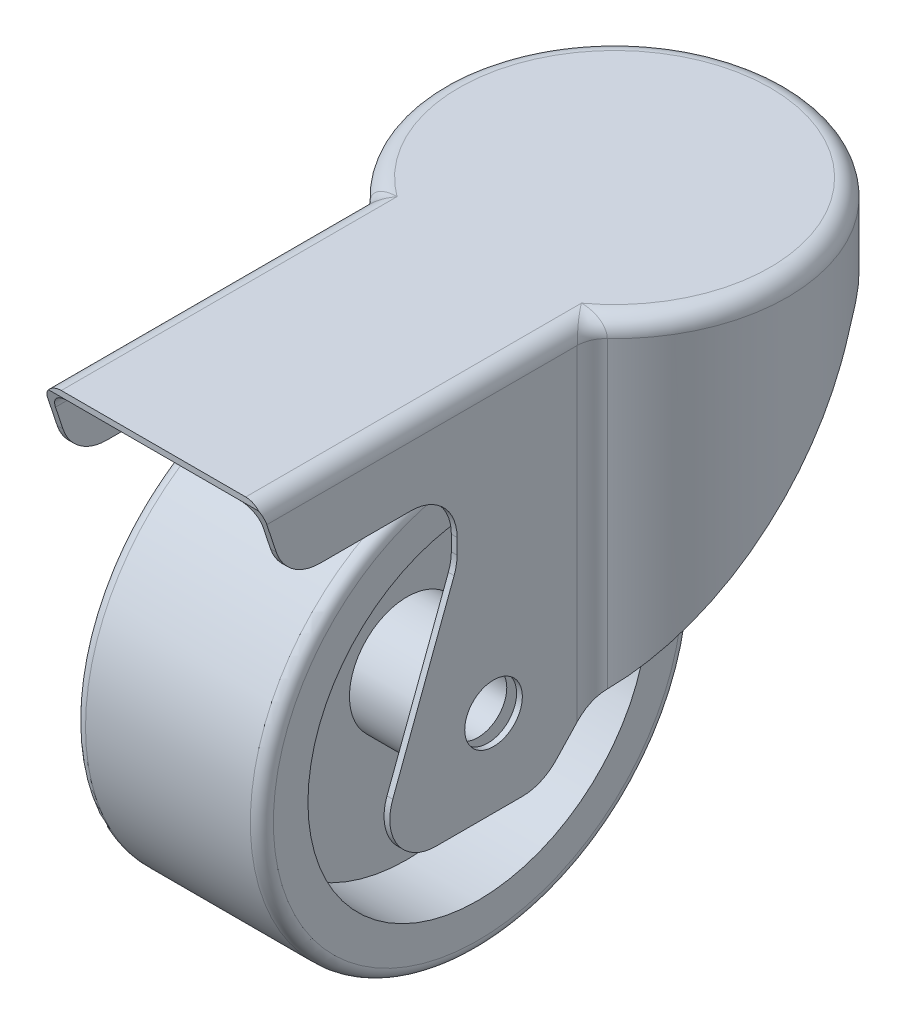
ISO-10303-21;
HEADER;
FILE_DESCRIPTION(('STEP AP214'),'2;1');
FILE_NAME('part.step','',(''),(''),'','','');
FILE_SCHEMA(('AUTOMOTIVE_DESIGN { 1 0 10303 214 1 1 1 1 }'));
ENDSEC;
DATA;
#1=APPLICATION_CONTEXT('core data for automotive mechanical design processes');
#2=APPLICATION_PROTOCOL_DEFINITION('international standard','automotive_design',2000,#1);
#3=PRODUCT_CONTEXT('',#1,'mechanical');
#4=PRODUCT('Part','Part','',(#3));
#5=PRODUCT_RELATED_PRODUCT_CATEGORY('part','',(#4));
#6=PRODUCT_DEFINITION_FORMATION('','',#4);
#7=PRODUCT_DEFINITION_CONTEXT('part definition',#1,'design');
#8=PRODUCT_DEFINITION('design','',#6,#7);
#9=PRODUCT_DEFINITION_SHAPE('','',#8);
#10=(LENGTH_UNIT() NAMED_UNIT(*) SI_UNIT(.MILLI.,.METRE.));
#11=(NAMED_UNIT(*) PLANE_ANGLE_UNIT() SI_UNIT($,.RADIAN.));
#12=(NAMED_UNIT(*) SI_UNIT($,.STERADIAN.) SOLID_ANGLE_UNIT());
#13=UNCERTAINTY_MEASURE_WITH_UNIT(LENGTH_MEASURE(1.E-05),#10,'distance_accuracy_value','');
#14=(GEOMETRIC_REPRESENTATION_CONTEXT(3) GLOBAL_UNCERTAINTY_ASSIGNED_CONTEXT((#13)) GLOBAL_UNIT_ASSIGNED_CONTEXT((#10,
#11,#12)) REPRESENTATION_CONTEXT('',''));
#15=CARTESIAN_POINT('',(0.,0.,0.));
#16=DIRECTION('',(0.,0.,1.));
#17=DIRECTION('',(1.,0.,0.));
#18=AXIS2_PLACEMENT_3D('',#15,#16,#17);
#19=CARTESIAN_POINT('',(0.,-15.,0.));
#20=DIRECTION('',(0.,1.,0.));
#21=DIRECTION('',(0.,0.,1.));
#22=AXIS2_PLACEMENT_3D('',#19,#20,#21);
#23=PLANE('',#22);
#24=DIRECTION('',(0.,0.,1.));
#25=VECTOR('',#24,1.);
#26=CARTESIAN_POINT('',(19.,-15.,0.));
#27=LINE('',#26,#25);
#28=CARTESIAN_POINT('',(19.,-15.,-5.));
#29=VERTEX_POINT('',#28);
#30=CARTESIAN_POINT('',(19.,-15.,10.));
#31=VERTEX_POINT('',#30);
#32=EDGE_CURVE('E816',#29,#31,#27,.T.);
#33=ORIENTED_EDGE('',*,*,#32,.T.);
#34=DIRECTION('',(1.,0.,0.));
#35=VECTOR('',#34,1.);
#36=CARTESIAN_POINT('',(-30.,-15.,10.));
#37=LINE('',#36,#35);
#38=CARTESIAN_POINT('',(18.,-15.,10.));
#39=VERTEX_POINT('',#38);
#40=EDGE_CURVE('E565',#31,#39,#37,.F.);
#41=ORIENTED_EDGE('',*,*,#40,.T.);
#42=DIRECTION('',(0.,0.,-1.));
#43=VECTOR('',#42,1.);
#44=CARTESIAN_POINT('',(18.,-15.,0.));
#45=LINE('',#44,#43);
#46=CARTESIAN_POINT('',(18.,-15.,-5.));
#47=VERTEX_POINT('',#46);
#48=EDGE_CURVE('E798',#39,#47,#45,.T.);
#49=ORIENTED_EDGE('',*,*,#48,.T.);
#50=DIRECTION('',(1.,0.,0.));
#51=VECTOR('',#50,1.);
#52=CARTESIAN_POINT('',(-30.,-15.,-5.));
#53=LINE('',#52,#51);
#54=EDGE_CURVE('E561',#29,#47,#53,.F.);
#55=ORIENTED_EDGE('',*,*,#54,.F.);
#56=EDGE_LOOP('',(#33,#41,#49,#55));
#57=FACE_BOUND('',#56,.T.);
#58=ADVANCED_FACE('F48',(#57),#23,.F.);
#59=DIRECTION('',(0.,0.,-1.));
#60=VECTOR('',#59,1.);
#61=CARTESIAN_POINT('',(-18.,-15.,0.));
#62=LINE('',#61,#60);
#63=CARTESIAN_POINT('',(-18.,-15.,10.));
#64=VERTEX_POINT('',#63);
#65=CARTESIAN_POINT('',(-18.,-15.,-5.));
#66=VERTEX_POINT('',#65);
#67=EDGE_CURVE('E554',#64,#66,#62,.T.);
#68=ORIENTED_EDGE('',*,*,#67,.F.);
#69=CARTESIAN_POINT('',(-19.,-15.,10.));
#70=VERTEX_POINT('',#69);
#71=EDGE_CURVE('E562',#64,#70,#37,.F.);
#72=ORIENTED_EDGE('',*,*,#71,.T.);
#73=DIRECTION('',(0.,0.,1.));
#74=VECTOR('',#73,1.);
#75=CARTESIAN_POINT('',(-19.,-15.,0.));
#76=LINE('',#75,#74);
#77=CARTESIAN_POINT('',(-19.,-15.,-5.));
#78=VERTEX_POINT('',#77);
#79=EDGE_CURVE('E557',#78,#70,#76,.T.);
#80=ORIENTED_EDGE('',*,*,#79,.F.);
#81=EDGE_CURVE('E446',#66,#78,#53,.F.);
#82=ORIENTED_EDGE('',*,*,#81,.F.);
#83=EDGE_LOOP('',(#68,#72,#80,#82));
#84=FACE_BOUND('',#83,.T.);
#85=ADVANCED_FACE('F419',(#84),#23,.F.);
#86=CARTESIAN_POINT('',(0.,-15.,-40.));
#87=DIRECTION('',(0.,1.,0.));
#88=DIRECTION('',(0.,0.,1.));
#89=AXIS2_PLACEMENT_3D('',#86,#87,#88);
#90=CYLINDRICAL_SURFACE('',#89,29.);
#91=DIRECTION('',(0.,1.,0.));
#92=VECTOR('',#91,1.);
#93=CARTESIAN_POINT('',(18.,-15.,-17.2623659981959));
#94=LINE('',#93,#92);
#95=CARTESIAN_POINT('',(18.,-5.61867316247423,-17.2623659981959));
#96=VERTEX_POINT('',#95);
#97=CARTESIAN_POINT('',(18.,47.,-17.2623659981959));
#98=VERTEX_POINT('',#97);
#99=EDGE_CURVE('E447',#96,#98,#94,.T.);
#100=ORIENTED_EDGE('',*,*,#99,.T.);
#101=CARTESIAN_POINT('',(0.,47.,-40.));
#102=DIRECTION('',(0.,1.,0.));
#103=DIRECTION('',(0.,0.,1.));
#104=AXIS2_PLACEMENT_3D('',#101,#102,#103);
#105=CIRCLE('',#104,29.);
#106=CARTESIAN_POINT('',(-18.,47.,-17.2623659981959));
#107=VERTEX_POINT('',#106);
#108=EDGE_CURVE('E460',#98,#107,#105,.T.);
#109=ORIENTED_EDGE('',*,*,#108,.T.);
#110=DIRECTION('',(0.,1.,0.));
#111=VECTOR('',#110,1.);
#112=CARTESIAN_POINT('',(-18.,-15.,-17.2623659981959));
#113=LINE('',#112,#111);
#114=CARTESIAN_POINT('',(-18.,-5.61867316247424,-17.2623659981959));
#115=VERTEX_POINT('',#114);
#116=EDGE_CURVE('E440',#115,#107,#113,.T.);
#117=ORIENTED_EDGE('',*,*,#116,.F.);
#118=CARTESIAN_POINT('',(0.,18.6290817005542,-40.));
#119=DIRECTION('',(0.,0.684027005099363,0.729456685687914));
#120=DIRECTION('',(0.,0.729456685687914,-0.684027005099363));
#121=AXIS2_PLACEMENT_3D('',#118,#119,#120);
#122=ELLIPSE('',#121,42.3959869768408,29.);
#123=CARTESIAN_POINT('',(-25.3055584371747,33.7341538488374,-54.1643465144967));
#124=VERTEX_POINT('',#123);
#125=EDGE_CURVE('E753',#115,#124,#122,.F.);
#126=ORIENTED_EDGE('',*,*,#125,.T.);
#127=CARTESIAN_POINT('',(-25.3055584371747,33.7341538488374,-54.1643465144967));
#128=CARTESIAN_POINT('',(-25.2598690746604,33.8212047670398,-54.2459746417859));
#129=CARTESIAN_POINT('',(-25.2127825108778,33.9060195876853,-54.3291698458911));
#130=CARTESIAN_POINT('',(-25.1158502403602,34.0710993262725,-54.4983989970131));
#131=CARTESIAN_POINT('',(-25.0660048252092,34.1513647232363,-54.5844326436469));
#132=CARTESIAN_POINT('',(-24.9124569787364,34.3851120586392,-54.8462233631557));
#133=CARTESIAN_POINT('',(-24.8046637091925,34.5316961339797,-55.0258125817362));
#134=CARTESIAN_POINT('',(-24.5809964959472,34.8032241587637,-55.3889302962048));
#135=CARTESIAN_POINT('',(-24.4653289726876,34.9285444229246,-55.5723066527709));
#136=CARTESIAN_POINT('',(-24.2246013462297,35.1611143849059,-55.9442078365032));
#137=CARTESIAN_POINT('',(-24.0995428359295,35.2683671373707,-56.1327317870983));
#138=CARTESIAN_POINT('',(-23.8401777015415,35.4654913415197,-56.5136033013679));
#139=CARTESIAN_POINT('',(-23.7058395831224,35.5552992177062,-56.7059621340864));
#140=CARTESIAN_POINT('',(-23.4275497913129,35.7185143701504,-57.0940914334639));
#141=CARTESIAN_POINT('',(-23.283512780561,35.7917416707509,-57.2898765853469));
#142=CARTESIAN_POINT('',(-23.1356486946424,35.85648539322,-57.4854728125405));
#143=B_SPLINE_CURVE_WITH_KNOTS('',3,(#127,#128,#129,#130,#131,#132,#133,#134,#135,#136,#137,
#138,#139,#140,#141,#142),.UNSPECIFIED.,.F.,.F.,(4,2,2,2,2,2,2,4),(0.,0.38327009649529,
0.766499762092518,1.53229531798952,2.28267067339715,3.0329190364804,3.78585229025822,
4.54660351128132),.UNSPECIFIED.);
#144=CARTESIAN_POINT('',(-23.1356486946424,35.85648539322,-57.4854728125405));
#145=VERTEX_POINT('',#144);
#146=EDGE_CURVE('E352',#124,#145,#143,.T.);
#147=ORIENTED_EDGE('',*,*,#146,.T.);
#148=CARTESIAN_POINT('',(0.,30.0671087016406,-40.));
#149=DIRECTION('',(0.,0.949318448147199,0.314315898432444));
#150=DIRECTION('',(0.,0.314315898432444,-0.949318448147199));
#151=AXIS2_PLACEMENT_3D('',#148,#149,#150);
#152=ELLIPSE('',#151,30.5482317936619,29.);
#153=CARTESIAN_POINT('',(23.1356486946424,35.85648539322,-57.4854728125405));
#154=VERTEX_POINT('',#153);
#155=EDGE_CURVE('E340',#145,#154,#152,.F.);
#156=ORIENTED_EDGE('',*,*,#155,.T.);
#157=CARTESIAN_POINT('',(23.1356486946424,35.85648539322,-57.4854728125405));
#158=CARTESIAN_POINT('',(23.284633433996,35.7912529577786,-57.2883961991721));
#159=CARTESIAN_POINT('',(23.4297353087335,35.7174037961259,-57.091121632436));
#160=CARTESIAN_POINT('',(23.7116390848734,35.5517229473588,-56.6977939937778));
#161=CARTESIAN_POINT('',(23.8484302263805,35.4598685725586,-56.501742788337));
#162=CARTESIAN_POINT('',(24.1099274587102,35.2597858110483,-56.1172079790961));
#163=CARTESIAN_POINT('',(24.2348314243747,35.1519561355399,-55.9286524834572));
#164=CARTESIAN_POINT('',(24.4751142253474,34.9183028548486,-55.5569187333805));
#165=CARTESIAN_POINT('',(24.5905001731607,34.7924928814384,-55.3737365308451));
#166=CARTESIAN_POINT('',(24.8114769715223,34.5225483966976,-55.0144956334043));
#167=CARTESIAN_POINT('',(24.9170514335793,34.3783841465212,-54.8384491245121));
#168=CARTESIAN_POINT('',(25.1188659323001,34.070616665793,-54.4942456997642));
#169=CARTESIAN_POINT('',(25.2149904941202,33.9068170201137,-54.3261968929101));
#170=CARTESIAN_POINT('',(25.3055584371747,33.7341538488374,-54.1643465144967));
#171=B_SPLINE_CURVE_WITH_KNOTS('',3,(#157,#158,#159,#160,#161,#162,#163,#164,#165,#166,#167,
#168,#169,#170),.UNSPECIFIED.,.F.,.F.,(4,2,2,2,2,2,4),(0.,0.766523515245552,1.53401917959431,
2.28485484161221,3.03512424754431,3.78662514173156,4.54639394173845),.UNSPECIFIED.);
#172=CARTESIAN_POINT('',(25.3055584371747,33.7341538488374,-54.1643465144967));
#173=VERTEX_POINT('',#172);
#174=EDGE_CURVE('E343',#154,#173,#171,.T.);
#175=ORIENTED_EDGE('',*,*,#174,.T.);
#176=EDGE_CURVE('E553',#173,#96,#122,.F.);
#177=ORIENTED_EDGE('',*,*,#176,.T.);
#178=EDGE_LOOP('',(#100,#109,#117,#126,#147,#156,#175,#177));
#179=FACE_BOUND('',#178,.T.);
#180=ADVANCED_FACE('F358',(#179),#90,.F.);
#181=CARTESIAN_POINT('',(-18.,-15.,0.));
#182=DIRECTION('',(1.,0.,0.));
#183=DIRECTION('',(0.,0.,-1.));
#184=AXIS2_PLACEMENT_3D('',#181,#182,#183);
#185=PLANE('',#184);
#186=CARTESIAN_POINT('',(-18.,0.,0.));
#187=DIRECTION('',(1.,0.,0.));
#188=DIRECTION('',(0.,0.,-1.));
#189=AXIS2_PLACEMENT_3D('',#186,#187,#188);
#190=CIRCLE('',#189,5.);
#191=CARTESIAN_POINT('',(-18.,0.,-5.));
#192=VERTEX_POINT('',#191);
#193=EDGE_CURVE('E337',#192,#192,#190,.T.);
#194=ORIENTED_EDGE('',*,*,#193,.F.);
#195=EDGE_LOOP('',(#194));
#196=FACE_BOUND('',#195,.T.);
#197=ORIENTED_EDGE('',*,*,#116,.T.);
#198=DIRECTION('',(0.,0.,-1.));
#199=VECTOR('',#198,1.);
#200=CARTESIAN_POINT('',(-18.,47.,0.));
#201=LINE('',#200,#199);
#202=CARTESIAN_POINT('',(-18.,47.,39.0067108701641));
#203=VERTEX_POINT('',#202);
#204=EDGE_CURVE('E442',#107,#203,#201,.F.);
#205=ORIENTED_EDGE('',*,*,#204,.T.);
#206=DIRECTION('',(0.,0.949318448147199,0.314315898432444));
#207=VECTOR('',#206,1.);
#208=CARTESIAN_POINT('',(-18.,-20.5137937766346,16.653138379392));
#209=LINE('',#208,#207);
#210=CARTESIAN_POINT('',(-18.,43.0709634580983,37.7058211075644));
#211=VERTEX_POINT('',#210);
#212=EDGE_CURVE('E305',#211,#203,#209,.T.);
#213=ORIENTED_EDGE('',*,*,#212,.F.);
#214=CARTESIAN_POINT('',(-18.,45.5854906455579,30.1112735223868));
#215=DIRECTION('',(1.,0.,0.));
#216=DIRECTION('',(0.,0.,-1.));
#217=AXIS2_PLACEMENT_3D('',#214,#215,#216);
#218=CIRCLE('',#217,8.);
#219=CARTESIAN_POINT('',(-18.,37.5854906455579,30.1112735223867));
#220=VERTEX_POINT('',#219);
#221=EDGE_CURVE('E314',#220,#211,#218,.F.);
#222=ORIENTED_EDGE('',*,*,#221,.F.);
#223=DIRECTION('',(0.,0.,1.));
#224=VECTOR('',#223,1.);
#225=CARTESIAN_POINT('',(-18.,37.5854906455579,0.));
#226=LINE('',#225,#224);
#227=CARTESIAN_POINT('',(-18.,37.5854906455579,14.3251253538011));
#228=VERTEX_POINT('',#227);
#229=EDGE_CURVE('E327',#228,#220,#226,.T.);
#230=ORIENTED_EDGE('',*,*,#229,.F.);
#231=CARTESIAN_POINT('',(-18.,29.5854906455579,14.325125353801));
#232=DIRECTION('',(1.,0.,0.));
#233=DIRECTION('',(0.,0.,-1.));
#234=AXIS2_PLACEMENT_3D('',#231,#232,#233);
#235=CIRCLE('',#234,8.);
#236=CARTESIAN_POINT('',(-18.,29.5854906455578,6.32512535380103));
#237=VERTEX_POINT('',#236);
#238=EDGE_CURVE('E786',#237,#228,#235,.T.);
#239=ORIENTED_EDGE('',*,*,#238,.F.);
#240=DIRECTION('',(0.,1.,0.));
#241=VECTOR('',#240,1.);
#242=CARTESIAN_POINT('',(-18.,-15.,6.32512535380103));
#243=LINE('',#242,#241);
#244=CARTESIAN_POINT('',(-18.,26.9205748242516,6.32512535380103));
#245=VERTEX_POINT('',#244);
#246=EDGE_CURVE('E779',#245,#237,#243,.T.);
#247=ORIENTED_EDGE('',*,*,#246,.F.);
#248=CARTESIAN_POINT('',(-18.,26.9205748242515,14.325125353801));
#249=DIRECTION('',(1.,0.,0.));
#250=DIRECTION('',(0.,0.,-1.));
#251=AXIS2_PLACEMENT_3D('',#248,#249,#250);
#252=CIRCLE('',#251,8.00000000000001);
#253=CARTESIAN_POINT('',(-18.,24.1016911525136,6.8382104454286));
#254=VERTEX_POINT('',#253);
#255=EDGE_CURVE('E772',#254,#245,#252,.T.);
#256=ORIENTED_EDGE('',*,*,#255,.F.);
#257=DIRECTION('',(0.,0.935864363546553,-0.352360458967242));
#258=VECTOR('',#257,1.);
#259=CARTESIAN_POINT('',(-18.,-7.89023721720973,18.8834287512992));
#260=LINE('',#259,#258);
#261=CARTESIAN_POINT('',(-18.,-4.18111632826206,17.4869149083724));
#262=VERTEX_POINT('',#261);
#263=EDGE_CURVE('E765',#262,#254,#260,.T.);
#264=ORIENTED_EDGE('',*,*,#263,.F.);
#265=CARTESIAN_POINT('',(-18.,-7.,10.));
#266=DIRECTION('',(1.,0.,0.));
#267=DIRECTION('',(0.,0.,-1.));
#268=AXIS2_PLACEMENT_3D('',#265,#266,#267);
#269=CIRCLE('',#268,8.);
#270=EDGE_CURVE('E751',#64,#262,#269,.F.);
#271=ORIENTED_EDGE('',*,*,#270,.F.);
#272=ORIENTED_EDGE('',*,*,#67,.T.);
#273=CARTESIAN_POINT('',(-18.,-7.,-5.));
#274=DIRECTION('',(1.,0.,0.));
#275=DIRECTION('',(0.,0.,-1.));
#276=AXIS2_PLACEMENT_3D('',#273,#274,#275);
#277=CIRCLE('',#276,8.);
#278=CARTESIAN_POINT('',(-18.,-12.4722160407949,-10.8356534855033));
#279=VERTEX_POINT('',#278);
#280=EDGE_CURVE('E741',#279,#66,#277,.F.);
#281=ORIENTED_EDGE('',*,*,#280,.F.);
#282=DIRECTION('',(0.,-0.729456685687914,0.684027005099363));
#283=VECTOR('',#282,1.);
#284=CARTESIAN_POINT('',(-18.,-19.2239128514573,-4.5044441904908));
#285=LINE('',#284,#283);
#286=EDGE_CURVE('E444',#115,#279,#285,.T.);
#287=ORIENTED_EDGE('',*,*,#286,.F.);
#288=EDGE_LOOP('',(#197,#205,#213,#222,#230,#239,#247,#256,#264,#271,#272,#281,#287));
#289=FACE_BOUND('',#288,.T.);
#290=ADVANCED_FACE('F426',(#196,#289),#185,.T.);
#291=CARTESIAN_POINT('',(-19.,-15.,0.));
#292=DIRECTION('',(-1.,0.,0.));
#293=DIRECTION('',(0.,0.,1.));
#294=AXIS2_PLACEMENT_3D('',#291,#292,#293);
#295=PLANE('',#294);
#296=CARTESIAN_POINT('',(-19.,0.,0.));
#297=DIRECTION('',(-1.,0.,0.));
#298=DIRECTION('',(0.,0.,1.));
#299=AXIS2_PLACEMENT_3D('',#296,#297,#298);
#300=CIRCLE('',#299,5.);
#301=CARTESIAN_POINT('',(-19.,0.,5.));
#302=VERTEX_POINT('',#301);
#303=EDGE_CURVE('E334',#302,#302,#300,.T.);
#304=ORIENTED_EDGE('',*,*,#303,.F.);
#305=EDGE_LOOP('',(#304));
#306=FACE_BOUND('',#305,.T.);
#307=DIRECTION('',(0.,0.,1.));
#308=VECTOR('',#307,1.);
#309=CARTESIAN_POINT('',(-19.,48.,0.));
#310=LINE('',#309,#308);
#311=CARTESIAN_POINT('',(-19.,48.,39.337807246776));
#312=VERTEX_POINT('',#311);
#313=CARTESIAN_POINT('',(-19.,48.,-14.524521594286));
#314=VERTEX_POINT('',#313);
#315=EDGE_CURVE('E520',#312,#314,#310,.F.);
#316=ORIENTED_EDGE('',*,*,#315,.T.);
#317=DIRECTION('',(0.,-1.,0.));
#318=VECTOR('',#317,1.);
#319=CARTESIAN_POINT('',(-19.,-6.12920819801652,-14.524521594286));
#320=LINE('',#319,#318);
#321=CARTESIAN_POINT('',(-19.,-8.53835161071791,-14.524521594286));
#322=VERTEX_POINT('',#321);
#323=EDGE_CURVE('E70',#314,#322,#320,.T.);
#324=ORIENTED_EDGE('',*,*,#323,.T.);
#325=DIRECTION('',(0.,0.729456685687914,-0.684027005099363));
#326=VECTOR('',#325,1.);
#327=CARTESIAN_POINT('',(-19.,-19.2239128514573,-4.5044441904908));
#328=LINE('',#327,#326);
#329=CARTESIAN_POINT('',(-19.,-12.4722160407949,-10.8356534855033));
#330=VERTEX_POINT('',#329);
#331=EDGE_CURVE('E757',#330,#322,#328,.T.);
#332=ORIENTED_EDGE('',*,*,#331,.F.);
#333=CARTESIAN_POINT('',(-19.,-7.,-5.));
#334=DIRECTION('',(-1.,0.,0.));
#335=DIRECTION('',(0.,0.,1.));
#336=AXIS2_PLACEMENT_3D('',#333,#334,#335);
#337=CIRCLE('',#336,8.);
#338=EDGE_CURVE('E739',#78,#330,#337,.F.);
#339=ORIENTED_EDGE('',*,*,#338,.F.);
#340=ORIENTED_EDGE('',*,*,#79,.T.);
#341=CARTESIAN_POINT('',(-19.,-7.,10.));
#342=DIRECTION('',(-1.,0.,0.));
#343=DIRECTION('',(0.,0.,1.));
#344=AXIS2_PLACEMENT_3D('',#341,#342,#343);
#345=CIRCLE('',#344,8.);
#346=CARTESIAN_POINT('',(-19.,-4.18111632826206,17.4869149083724));
#347=VERTEX_POINT('',#346);
#348=EDGE_CURVE('E749',#347,#70,#345,.F.);
#349=ORIENTED_EDGE('',*,*,#348,.F.);
#350=DIRECTION('',(0.,-0.935864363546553,0.352360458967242));
#351=VECTOR('',#350,1.);
#352=CARTESIAN_POINT('',(-19.,-7.89023721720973,18.8834287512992));
#353=LINE('',#352,#351);
#354=CARTESIAN_POINT('',(-19.,24.1016911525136,6.8382104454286));
#355=VERTEX_POINT('',#354);
#356=EDGE_CURVE('E763',#355,#347,#353,.T.);
#357=ORIENTED_EDGE('',*,*,#356,.F.);
#358=CARTESIAN_POINT('',(-19.,26.9205748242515,14.325125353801));
#359=DIRECTION('',(-1.,0.,0.));
#360=DIRECTION('',(0.,0.,1.));
#361=AXIS2_PLACEMENT_3D('',#358,#359,#360);
#362=CIRCLE('',#361,8.00000000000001);
#363=CARTESIAN_POINT('',(-19.,26.9205748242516,6.32512535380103));
#364=VERTEX_POINT('',#363);
#365=EDGE_CURVE('E770',#364,#355,#362,.T.);
#366=ORIENTED_EDGE('',*,*,#365,.F.);
#367=DIRECTION('',(0.,-1.,0.));
#368=VECTOR('',#367,1.);
#369=CARTESIAN_POINT('',(-19.,-15.,6.32512535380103));
#370=LINE('',#369,#368);
#371=CARTESIAN_POINT('',(-19.,29.5854906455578,6.32512535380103));
#372=VERTEX_POINT('',#371);
#373=EDGE_CURVE('E777',#372,#364,#370,.T.);
#374=ORIENTED_EDGE('',*,*,#373,.F.);
#375=CARTESIAN_POINT('',(-19.,29.5854906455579,14.325125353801));
#376=DIRECTION('',(-1.,0.,0.));
#377=DIRECTION('',(0.,0.,1.));
#378=AXIS2_PLACEMENT_3D('',#375,#376,#377);
#379=CIRCLE('',#378,8.);
#380=CARTESIAN_POINT('',(-19.,37.5854906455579,14.3251253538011));
#381=VERTEX_POINT('',#380);
#382=EDGE_CURVE('E784',#381,#372,#379,.T.);
#383=ORIENTED_EDGE('',*,*,#382,.F.);
#384=DIRECTION('',(0.,0.,-1.));
#385=VECTOR('',#384,1.);
#386=CARTESIAN_POINT('',(-19.,37.5854906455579,0.));
#387=LINE('',#386,#385);
#388=CARTESIAN_POINT('',(-19.,37.5854906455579,30.1112735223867));
#389=VERTEX_POINT('',#388);
#390=EDGE_CURVE('E321',#389,#381,#387,.T.);
#391=ORIENTED_EDGE('',*,*,#390,.F.);
#392=CARTESIAN_POINT('',(-19.,45.5854906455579,30.1112735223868));
#393=DIRECTION('',(-1.,0.,0.));
#394=DIRECTION('',(0.,0.,1.));
#395=AXIS2_PLACEMENT_3D('',#392,#393,#394);
#396=CIRCLE('',#395,8.);
#397=CARTESIAN_POINT('',(-19.,43.0709634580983,37.7058211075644));
#398=VERTEX_POINT('',#397);
#399=EDGE_CURVE('E311',#398,#389,#396,.F.);
#400=ORIENTED_EDGE('',*,*,#399,.F.);
#401=DIRECTION('',(0.,-0.949318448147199,-0.314315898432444));
#402=VECTOR('',#401,1.);
#403=CARTESIAN_POINT('',(-19.,-20.5137937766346,16.653138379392));
#404=LINE('',#403,#402);
#405=EDGE_CURVE('E294',#312,#398,#404,.T.);
#406=ORIENTED_EDGE('',*,*,#405,.F.);
#407=EDGE_LOOP('',(#316,#324,#332,#339,#340,#349,#357,#366,#374,#383,#391,#400,#406));
#408=FACE_BOUND('',#407,.T.);
#409=ADVANCED_FACE('F319',(#306,#408),#295,.T.);
#410=CARTESIAN_POINT('',(0.,-15.,-40.));
#411=DIRECTION('',(0.,1.,0.));
#412=DIRECTION('',(0.,0.,1.));
#413=AXIS2_PLACEMENT_3D('',#410,#411,#412);
#414=CYLINDRICAL_SURFACE('',#413,30.);
#415=CARTESIAN_POINT('',(0.,48.,-40.));
#416=DIRECTION('',(0.,1.,0.));
#417=DIRECTION('',(0.,0.,1.));
#418=AXIS2_PLACEMENT_3D('',#415,#416,#417);
#419=CIRCLE('',#418,30.);
#420=CARTESIAN_POINT('',(-20.5714285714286,48.,-18.1638756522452));
#421=VERTEX_POINT('',#420);
#422=CARTESIAN_POINT('',(20.5714285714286,48.,-18.1638756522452));
#423=VERTEX_POINT('',#422);
#424=EDGE_CURVE('E525',#421,#423,#419,.F.);
#425=ORIENTED_EDGE('',*,*,#424,.T.);
#426=DIRECTION('',(0.,1.,0.));
#427=VECTOR('',#426,1.);
#428=CARTESIAN_POINT('',(20.5714285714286,-15.,-18.1638756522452));
#429=LINE('',#428,#427);
#430=CARTESIAN_POINT('',(20.5714285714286,-4.65728970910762,-18.1638756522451));
#431=VERTEX_POINT('',#430);
#432=EDGE_CURVE('E617',#423,#431,#429,.F.);
#433=ORIENTED_EDGE('',*,*,#432,.T.);
#434=CARTESIAN_POINT('',(0.,18.6290817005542,-40.));
#435=DIRECTION('',(0.,0.684027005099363,0.729456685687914));
#436=DIRECTION('',(0.,0.729456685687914,-0.684027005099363));
#437=AXIS2_PLACEMENT_3D('',#434,#435,#436);
#438=ELLIPSE('',#437,43.8579175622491,30.);
#439=CARTESIAN_POINT('',(26.4456288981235,33.7341538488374,-54.1643465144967));
#440=VERTEX_POINT('',#439);
#441=EDGE_CURVE('E605',#440,#431,#438,.F.);
#442=ORIENTED_EDGE('',*,*,#441,.F.);
#443=CARTESIAN_POINT('',(24.377412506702,35.85648539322,-57.4854728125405));
#444=CARTESIAN_POINT('',(24.5199578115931,35.790723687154,-57.2867922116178));
#445=CARTESIAN_POINT('',(24.6587178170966,35.7162850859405,-57.0881621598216));
#446=CARTESIAN_POINT('',(24.9281645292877,35.5494120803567,-56.6926178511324));
#447=CARTESIAN_POINT('',(25.0588412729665,35.4569560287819,-56.4957059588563));
#448=CARTESIAN_POINT('',(25.3085432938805,35.2557601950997,-56.1099161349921));
#449=CARTESIAN_POINT('',(25.4277593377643,35.1474154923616,-55.9209565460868));
#450=CARTESIAN_POINT('',(25.6570032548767,34.9129050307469,-55.5488230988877));
#451=CARTESIAN_POINT('',(25.7670378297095,34.7867524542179,-55.3656450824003));
#452=CARTESIAN_POINT('',(25.9771410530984,34.5170868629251,-55.0076977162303));
#453=CARTESIAN_POINT('',(26.0772438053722,34.3736372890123,-54.8329007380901));
#454=CARTESIAN_POINT('',(26.2685946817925,34.0678279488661,-54.4913759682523));
#455=CARTESIAN_POINT('',(26.3597343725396,33.9052790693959,-54.3247569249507));
#456=CARTESIAN_POINT('',(26.4456288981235,33.7341538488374,-54.1643465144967));
#457=B_SPLINE_CURVE_WITH_KNOTS('',3,(#443,#444,#445,#446,#447,#448,#449,#450,#451,#452,#453,
#454,#455,#456),.UNSPECIFIED.,.F.,.F.,(4,2,2,2,2,2,4),(0.,0.759594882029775,1.52010807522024,
2.2641861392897,3.0077162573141,3.74859782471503,4.49755666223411),.UNSPECIFIED.);
#458=CARTESIAN_POINT('',(24.3774125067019,35.85648539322,-57.4854728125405));
#459=VERTEX_POINT('',#458);
#460=EDGE_CURVE('E387',#459,#440,#457,.T.);
#461=ORIENTED_EDGE('',*,*,#460,.F.);
#462=CARTESIAN_POINT('',(0.,30.0671087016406,-40.));
#463=DIRECTION('',(0.,0.949318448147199,0.314315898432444));
#464=DIRECTION('',(0.,0.314315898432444,-0.949318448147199));
#465=AXIS2_PLACEMENT_3D('',#462,#463,#464);
#466=ELLIPSE('',#465,31.6016190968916,30.);
#467=CARTESIAN_POINT('',(-24.377412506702,35.85648539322,-57.4854728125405));
#468=VERTEX_POINT('',#467);
#469=EDGE_CURVE('E394',#468,#459,#466,.F.);
#470=ORIENTED_EDGE('',*,*,#469,.F.);
#471=CARTESIAN_POINT('',(-26.4456288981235,33.7341538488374,-54.1643465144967));
#472=CARTESIAN_POINT('',(-26.4020679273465,33.8208885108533,-54.2456781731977));
#473=CARTESIAN_POINT('',(-26.3571738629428,33.9054350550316,-54.3285951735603));
#474=CARTESIAN_POINT('',(-26.2647484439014,34.0700689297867,-54.4973183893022));
#475=CARTESIAN_POINT('',(-26.2172173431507,34.1501566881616,-54.5831243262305));
#476=CARTESIAN_POINT('',(-26.0707760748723,34.3835087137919,-54.8443396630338));
#477=CARTESIAN_POINT('',(-25.9679490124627,34.5299990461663,-55.0236760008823));
#478=CARTESIAN_POINT('',(-25.7545143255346,34.8016015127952,-55.3866315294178));
#479=CARTESIAN_POINT('',(-25.6441052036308,34.9270849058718,-55.5700916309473));
#480=CARTESIAN_POINT('',(-25.4142296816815,35.1601497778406,-55.9425477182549));
#481=CARTESIAN_POINT('',(-25.29476502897,35.2677346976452,-56.1315426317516));
#482=CARTESIAN_POINT('',(-25.0475562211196,35.4650733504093,-56.5127630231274));
#483=CARTESIAN_POINT('',(-24.919827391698,35.5548589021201,-56.7049820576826));
#484=CARTESIAN_POINT('',(-24.6551546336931,35.7181931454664,-57.093260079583));
#485=CARTESIAN_POINT('',(-24.5181291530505,35.7915645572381,-57.2893382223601));
#486=CARTESIAN_POINT('',(-24.377412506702,35.85648539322,-57.4854728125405));
#487=B_SPLINE_CURVE_WITH_KNOTS('',3,(#471,#472,#473,#474,#475,#476,#477,#478,#479,#480,#481,
#482,#483,#484,#485,#486),.UNSPECIFIED.,.F.,.F.,(4,2,2,2,2,2,2,4),(0.,0.379814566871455,
0.759592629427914,1.51854845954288,2.2622129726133,3.00573435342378,3.74791436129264,
4.49775994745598),.UNSPECIFIED.);
#488=CARTESIAN_POINT('',(-26.4456288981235,33.7341538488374,-54.1643465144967));
#489=VERTEX_POINT('',#488);
#490=EDGE_CURVE('E377',#489,#468,#487,.T.);
#491=ORIENTED_EDGE('',*,*,#490,.F.);
#492=CARTESIAN_POINT('',(-20.5714285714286,-4.65728970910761,-18.1638756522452));
#493=VERTEX_POINT('',#492);
#494=EDGE_CURVE('E755',#493,#489,#438,.F.);
#495=ORIENTED_EDGE('',*,*,#494,.F.);
#496=DIRECTION('',(0.,1.,0.));
#497=VECTOR('',#496,1.);
#498=CARTESIAN_POINT('',(-20.5714285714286,-15.,-18.1638756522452));
#499=LINE('',#498,#497);
#500=EDGE_CURVE('E614',#493,#421,#499,.T.);
#501=ORIENTED_EDGE('',*,*,#500,.T.);
#502=EDGE_LOOP('',(#425,#433,#442,#461,#470,#491,#495,#501));
#503=FACE_BOUND('',#502,.T.);
#504=ADVANCED_FACE('F396',(#503),#414,.T.);
#505=CARTESIAN_POINT('',(19.,-15.,0.));
#506=DIRECTION('',(-1.,0.,0.));
#507=DIRECTION('',(0.,0.,1.));
#508=AXIS2_PLACEMENT_3D('',#505,#506,#507);
#509=PLANE('',#508);
#510=CARTESIAN_POINT('',(19.,0.,0.));
#511=DIRECTION('',(-1.,0.,0.));
#512=DIRECTION('',(0.,0.,1.));
#513=AXIS2_PLACEMENT_3D('',#510,#511,#512);
#514=CIRCLE('',#513,5.);
#515=CARTESIAN_POINT('',(19.,0.,5.));
#516=VERTEX_POINT('',#515);
#517=EDGE_CURVE('E331',#516,#516,#514,.T.);
#518=ORIENTED_EDGE('',*,*,#517,.T.);
#519=EDGE_LOOP('',(#518));
#520=FACE_BOUND('',#519,.T.);
#521=DIRECTION('',(0.,0.729456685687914,-0.684027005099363));
#522=VECTOR('',#521,1.);
#523=CARTESIAN_POINT('',(19.,-19.2239128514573,-4.5044441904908));
#524=LINE('',#523,#522);
#525=CARTESIAN_POINT('',(19.,-12.4722160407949,-10.8356534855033));
#526=VERTEX_POINT('',#525);
#527=CARTESIAN_POINT('',(19.,-8.53835161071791,-14.524521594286));
#528=VERTEX_POINT('',#527);
#529=EDGE_CURVE('E596',#526,#528,#524,.T.);
#530=ORIENTED_EDGE('',*,*,#529,.T.);
#531=DIRECTION('',(0.,1.,0.));
#532=VECTOR('',#531,1.);
#533=CARTESIAN_POINT('',(19.,-15.,-14.524521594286));
#534=LINE('',#533,#532);
#535=CARTESIAN_POINT('',(19.,48.,-14.524521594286));
#536=VERTEX_POINT('',#535);
#537=EDGE_CURVE('E598',#528,#536,#534,.T.);
#538=ORIENTED_EDGE('',*,*,#537,.T.);
#539=DIRECTION('',(0.,0.,-1.));
#540=VECTOR('',#539,1.);
#541=CARTESIAN_POINT('',(19.,48.,40.));
#542=LINE('',#541,#540);
#543=CARTESIAN_POINT('',(19.,48.,39.337807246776));
#544=VERTEX_POINT('',#543);
#545=EDGE_CURVE('E534',#536,#544,#542,.F.);
#546=ORIENTED_EDGE('',*,*,#545,.T.);
#547=DIRECTION('',(0.,-0.949318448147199,-0.314315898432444));
#548=VECTOR('',#547,1.);
#549=CARTESIAN_POINT('',(19.,-20.5137937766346,16.653138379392));
#550=LINE('',#549,#548);
#551=CARTESIAN_POINT('',(19.,43.0709634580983,37.7058211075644));
#552=VERTEX_POINT('',#551);
#553=EDGE_CURVE('E306',#544,#552,#550,.T.);
#554=ORIENTED_EDGE('',*,*,#553,.T.);
#555=CARTESIAN_POINT('',(19.,45.5854906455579,30.1112735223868));
#556=DIRECTION('',(-1.,0.,0.));
#557=DIRECTION('',(0.,0.,1.));
#558=AXIS2_PLACEMENT_3D('',#555,#556,#557);
#559=CIRCLE('',#558,8.);
#560=CARTESIAN_POINT('',(19.,37.5854906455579,30.1112735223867));
#561=VERTEX_POINT('',#560);
#562=EDGE_CURVE('E322',#552,#561,#559,.F.);
#563=ORIENTED_EDGE('',*,*,#562,.T.);
#564=DIRECTION('',(0.,0.,-1.));
#565=VECTOR('',#564,1.);
#566=CARTESIAN_POINT('',(19.,37.5854906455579,0.));
#567=LINE('',#566,#565);
#568=CARTESIAN_POINT('',(19.,37.5854906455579,14.3251253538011));
#569=VERTEX_POINT('',#568);
#570=EDGE_CURVE('E788',#561,#569,#567,.T.);
#571=ORIENTED_EDGE('',*,*,#570,.T.);
#572=CARTESIAN_POINT('',(19.,29.5854906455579,14.325125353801));
#573=DIRECTION('',(-1.,0.,0.));
#574=DIRECTION('',(0.,0.,1.));
#575=AXIS2_PLACEMENT_3D('',#572,#573,#574);
#576=CIRCLE('',#575,8.);
#577=CARTESIAN_POINT('',(19.,29.5854906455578,6.32512535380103));
#578=VERTEX_POINT('',#577);
#579=EDGE_CURVE('E781',#569,#578,#576,.T.);
#580=ORIENTED_EDGE('',*,*,#579,.T.);
#581=DIRECTION('',(0.,-1.,0.));
#582=VECTOR('',#581,1.);
#583=CARTESIAN_POINT('',(19.,-15.,6.32512535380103));
#584=LINE('',#583,#582);
#585=CARTESIAN_POINT('',(19.,26.9205748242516,6.32512535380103));
#586=VERTEX_POINT('',#585);
#587=EDGE_CURVE('E774',#578,#586,#584,.T.);
#588=ORIENTED_EDGE('',*,*,#587,.T.);
#589=CARTESIAN_POINT('',(19.,26.9205748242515,14.325125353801));
#590=DIRECTION('',(-1.,0.,0.));
#591=DIRECTION('',(0.,0.,1.));
#592=AXIS2_PLACEMENT_3D('',#589,#590,#591);
#593=CIRCLE('',#592,8.00000000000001);
#594=CARTESIAN_POINT('',(19.,24.1016911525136,6.8382104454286));
#595=VERTEX_POINT('',#594);
#596=EDGE_CURVE('E767',#586,#595,#593,.T.);
#597=ORIENTED_EDGE('',*,*,#596,.T.);
#598=DIRECTION('',(0.,-0.935864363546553,0.352360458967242));
#599=VECTOR('',#598,1.);
#600=CARTESIAN_POINT('',(19.,-7.89023721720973,18.8834287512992));
#601=LINE('',#600,#599);
#602=CARTESIAN_POINT('',(19.,-4.18111632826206,17.4869149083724));
#603=VERTEX_POINT('',#602);
#604=EDGE_CURVE('E760',#595,#603,#601,.T.);
#605=ORIENTED_EDGE('',*,*,#604,.T.);
#606=CARTESIAN_POINT('',(19.,-7.,10.));
#607=DIRECTION('',(-1.,0.,0.));
#608=DIRECTION('',(0.,0.,1.));
#609=AXIS2_PLACEMENT_3D('',#606,#607,#608);
#610=CIRCLE('',#609,8.);
#611=EDGE_CURVE('E746',#603,#31,#610,.F.);
#612=ORIENTED_EDGE('',*,*,#611,.T.);
#613=ORIENTED_EDGE('',*,*,#32,.F.);
#614=CARTESIAN_POINT('',(19.,-7.,-5.));
#615=DIRECTION('',(-1.,0.,0.));
#616=DIRECTION('',(0.,0.,1.));
#617=AXIS2_PLACEMENT_3D('',#614,#615,#616);
#618=CIRCLE('',#617,8.);
#619=EDGE_CURVE('E601',#29,#526,#618,.F.);
#620=ORIENTED_EDGE('',*,*,#619,.T.);
#621=EDGE_LOOP('',(#530,#538,#546,#554,#563,#571,#580,#588,#597,#605,#612,#613,#620));
#622=FACE_BOUND('',#621,.T.);
#623=ADVANCED_FACE('F401',(#520,#622),#509,.F.);
#624=CARTESIAN_POINT('',(18.,-15.,0.));
#625=DIRECTION('',(1.,0.,0.));
#626=DIRECTION('',(0.,0.,-1.));
#627=AXIS2_PLACEMENT_3D('',#624,#625,#626);
#628=PLANE('',#627);
#629=CARTESIAN_POINT('',(18.,0.,0.));
#630=DIRECTION('',(1.,0.,0.));
#631=DIRECTION('',(0.,0.,-1.));
#632=AXIS2_PLACEMENT_3D('',#629,#630,#631);
#633=CIRCLE('',#632,5.);
#634=CARTESIAN_POINT('',(18.,0.,-5.));
#635=VERTEX_POINT('',#634);
#636=EDGE_CURVE('E324',#635,#635,#633,.T.);
#637=ORIENTED_EDGE('',*,*,#636,.T.);
#638=EDGE_LOOP('',(#637));
#639=FACE_BOUND('',#638,.T.);
#640=DIRECTION('',(0.,0.949318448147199,0.314315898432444));
#641=VECTOR('',#640,1.);
#642=CARTESIAN_POINT('',(18.,-20.5137937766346,16.653138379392));
#643=LINE('',#642,#641);
#644=CARTESIAN_POINT('',(18.,43.0709634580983,37.7058211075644));
#645=VERTEX_POINT('',#644);
#646=CARTESIAN_POINT('',(18.,47.,39.0067108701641));
#647=VERTEX_POINT('',#646);
#648=EDGE_CURVE('E315',#645,#647,#643,.T.);
#649=ORIENTED_EDGE('',*,*,#648,.T.);
#650=DIRECTION('',(0.,0.,-1.));
#651=VECTOR('',#650,1.);
#652=CARTESIAN_POINT('',(18.,47.,-17.2623659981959));
#653=LINE('',#652,#651);
#654=EDGE_CURVE('E393',#647,#98,#653,.T.);
#655=ORIENTED_EDGE('',*,*,#654,.T.);
#656=ORIENTED_EDGE('',*,*,#99,.F.);
#657=DIRECTION('',(0.,-0.729456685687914,0.684027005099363));
#658=VECTOR('',#657,1.);
#659=CARTESIAN_POINT('',(18.,-19.2239128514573,-4.5044441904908));
#660=LINE('',#659,#658);
#661=CARTESIAN_POINT('',(18.,-12.4722160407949,-10.8356534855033));
#662=VERTEX_POINT('',#661);
#663=EDGE_CURVE('E566',#96,#662,#660,.T.);
#664=ORIENTED_EDGE('',*,*,#663,.T.);
#665=CARTESIAN_POINT('',(18.,-7.,-5.));
#666=DIRECTION('',(1.,0.,0.));
#667=DIRECTION('',(0.,0.,-1.));
#668=AXIS2_PLACEMENT_3D('',#665,#666,#667);
#669=CIRCLE('',#668,8.);
#670=EDGE_CURVE('E735',#662,#47,#669,.F.);
#671=ORIENTED_EDGE('',*,*,#670,.T.);
#672=ORIENTED_EDGE('',*,*,#48,.F.);
#673=CARTESIAN_POINT('',(18.,-7.,10.));
#674=DIRECTION('',(1.,0.,0.));
#675=DIRECTION('',(0.,0.,-1.));
#676=AXIS2_PLACEMENT_3D('',#673,#674,#675);
#677=CIRCLE('',#676,8.);
#678=CARTESIAN_POINT('',(18.,-4.18111632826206,17.4869149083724));
#679=VERTEX_POINT('',#678);
#680=EDGE_CURVE('E743',#39,#679,#677,.F.);
#681=ORIENTED_EDGE('',*,*,#680,.T.);
#682=DIRECTION('',(0.,0.935864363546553,-0.352360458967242));
#683=VECTOR('',#682,1.);
#684=CARTESIAN_POINT('',(18.,-7.89023721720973,18.8834287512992));
#685=LINE('',#684,#683);
#686=CARTESIAN_POINT('',(18.,24.1016911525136,6.8382104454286));
#687=VERTEX_POINT('',#686);
#688=EDGE_CURVE('E568',#679,#687,#685,.T.);
#689=ORIENTED_EDGE('',*,*,#688,.T.);
#690=CARTESIAN_POINT('',(18.,26.9205748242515,14.325125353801));
#691=DIRECTION('',(1.,0.,0.));
#692=DIRECTION('',(0.,0.,-1.));
#693=AXIS2_PLACEMENT_3D('',#690,#691,#692);
#694=CIRCLE('',#693,8.00000000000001);
#695=CARTESIAN_POINT('',(18.,26.9205748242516,6.32512535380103));
#696=VERTEX_POINT('',#695);
#697=EDGE_CURVE('E571',#687,#696,#694,.T.);
#698=ORIENTED_EDGE('',*,*,#697,.T.);
#699=DIRECTION('',(0.,1.,0.));
#700=VECTOR('',#699,1.);
#701=CARTESIAN_POINT('',(18.,-15.,6.32512535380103));
#702=LINE('',#701,#700);
#703=CARTESIAN_POINT('',(18.,29.5854906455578,6.32512535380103));
#704=VERTEX_POINT('',#703);
#705=EDGE_CURVE('E574',#696,#704,#702,.T.);
#706=ORIENTED_EDGE('',*,*,#705,.T.);
#707=CARTESIAN_POINT('',(18.,29.5854906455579,14.325125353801));
#708=DIRECTION('',(1.,0.,0.));
#709=DIRECTION('',(0.,0.,-1.));
#710=AXIS2_PLACEMENT_3D('',#707,#708,#709);
#711=CIRCLE('',#710,8.);
#712=CARTESIAN_POINT('',(18.,37.5854906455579,14.3251253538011));
#713=VERTEX_POINT('',#712);
#714=EDGE_CURVE('E577',#704,#713,#711,.T.);
#715=ORIENTED_EDGE('',*,*,#714,.T.);
#716=DIRECTION('',(0.,0.,1.));
#717=VECTOR('',#716,1.);
#718=CARTESIAN_POINT('',(18.,37.5854906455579,0.));
#719=LINE('',#718,#717);
#720=CARTESIAN_POINT('',(18.,37.5854906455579,30.1112735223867));
#721=VERTEX_POINT('',#720);
#722=EDGE_CURVE('E580',#713,#721,#719,.T.);
#723=ORIENTED_EDGE('',*,*,#722,.T.);
#724=CARTESIAN_POINT('',(18.,45.5854906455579,30.1112735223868));
#725=DIRECTION('',(1.,0.,0.));
#726=DIRECTION('',(0.,0.,-1.));
#727=AXIS2_PLACEMENT_3D('',#724,#725,#726);
#728=CIRCLE('',#727,8.);
#729=EDGE_CURVE('E583',#721,#645,#728,.F.);
#730=ORIENTED_EDGE('',*,*,#729,.T.);
#731=EDGE_LOOP('',(#649,#655,#656,#664,#671,#672,#681,#689,#698,#706,#715,#723,#730));
#732=FACE_BOUND('',#731,.T.);
#733=ADVANCED_FACE('F406',(#639,#732),#628,.F.);
#734=CARTESIAN_POINT('',(-30.,43.0709634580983,37.7058211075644));
#735=DIRECTION('',(0.,0.314315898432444,-0.949318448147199));
#736=DIRECTION('',(0.,0.949318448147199,0.314315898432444));
#737=AXIS2_PLACEMENT_3D('',#734,#735,#736);
#738=PLANE('',#737);
#739=DIRECTION('',(1.,0.,0.));
#740=VECTOR('',#739,1.);
#741=CARTESIAN_POINT('',(0.,50.,40.));
#742=LINE('',#741,#740);
#743=CARTESIAN_POINT('',(-18.2360679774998,50.,40.));
#744=VERTEX_POINT('',#743);
#745=CARTESIAN_POINT('',(-15.,50.,40.));
#746=VERTEX_POINT('',#745);
#747=EDGE_CURVE('E797',#744,#746,#742,.T.);
#748=ORIENTED_EDGE('',*,*,#747,.F.);
#749=CARTESIAN_POINT('',(-16.,48.,39.337807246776));
#750=DIRECTION('',(0.,0.314315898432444,-0.949318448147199));
#751=DIRECTION('',(0.,0.949318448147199,0.314315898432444));
#752=AXIS2_PLACEMENT_3D('',#749,#750,#751);
#753=ELLIPSE('',#752,3.16016190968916,3.);
#754=EDGE_CURVE('E302',#744,#312,#753,.F.);
#755=ORIENTED_EDGE('',*,*,#754,.T.);
#756=ORIENTED_EDGE('',*,*,#405,.T.);
#757=DIRECTION('',(1.,0.,0.));
#758=VECTOR('',#757,1.);
#759=CARTESIAN_POINT('',(-30.,43.0709634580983,37.7058211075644));
#760=LINE('',#759,#758);
#761=EDGE_CURVE('E299',#398,#211,#760,.T.);
#762=ORIENTED_EDGE('',*,*,#761,.T.);
#763=ORIENTED_EDGE('',*,*,#212,.T.);
#764=CARTESIAN_POINT('',(-15.,47.,39.0067108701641));
#765=DIRECTION('',(0.,0.314315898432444,-0.949318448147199));
#766=DIRECTION('',(0.,-0.949318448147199,-0.314315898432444));
#767=AXIS2_PLACEMENT_3D('',#764,#765,#766);
#768=ELLIPSE('',#767,3.16016190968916,3.);
#769=EDGE_CURVE('E458',#203,#746,#768,.T.);
#770=ORIENTED_EDGE('',*,*,#769,.T.);
#771=EDGE_LOOP('',(#748,#755,#756,#762,#763,#770));
#772=FACE_BOUND('',#771,.T.);
#773=ADVANCED_FACE('F297',(#772),#738,.F.);
#774=CARTESIAN_POINT('',(-30.,-7.,10.));
#775=DIRECTION('',(1.,0.,0.));
#776=DIRECTION('',(0.,0.,-1.));
#777=AXIS2_PLACEMENT_3D('',#774,#775,#776);
#778=CYLINDRICAL_SURFACE('',#777,8.);
#779=ORIENTED_EDGE('',*,*,#270,.T.);
#780=DIRECTION('',(1.,0.,0.));
#781=VECTOR('',#780,1.);
#782=CARTESIAN_POINT('',(-30.,-4.18111632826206,17.4869149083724));
#783=LINE('',#782,#781);
#784=EDGE_CURVE('E721',#347,#262,#783,.T.);
#785=ORIENTED_EDGE('',*,*,#784,.F.);
#786=ORIENTED_EDGE('',*,*,#348,.T.);
#787=ORIENTED_EDGE('',*,*,#71,.F.);
#788=EDGE_LOOP('',(#779,#785,#786,#787));
#789=FACE_BOUND('',#788,.T.);
#790=ADVANCED_FACE('F413',(#789),#778,.T.);
#791=CARTESIAN_POINT('',(-30.,-4.18111632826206,17.4869149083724));
#792=DIRECTION('',(0.,-0.352360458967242,-0.935864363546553));
#793=DIRECTION('',(0.,0.935864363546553,-0.352360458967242));
#794=AXIS2_PLACEMENT_3D('',#791,#792,#793);
#795=PLANE('',#794);
#796=ORIENTED_EDGE('',*,*,#263,.T.);
#797=DIRECTION('',(1.,0.,0.));
#798=VECTOR('',#797,1.);
#799=CARTESIAN_POINT('',(-30.,24.1016911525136,6.8382104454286));
#800=LINE('',#799,#798);
#801=EDGE_CURVE('E717',#355,#254,#800,.T.);
#802=ORIENTED_EDGE('',*,*,#801,.F.);
#803=ORIENTED_EDGE('',*,*,#356,.T.);
#804=ORIENTED_EDGE('',*,*,#784,.T.);
#805=EDGE_LOOP('',(#796,#802,#803,#804));
#806=FACE_BOUND('',#805,.T.);
#807=ADVANCED_FACE('F835',(#806),#795,.F.);
#808=CARTESIAN_POINT('',(-30.,26.9205748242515,14.325125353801));
#809=DIRECTION('',(1.,0.,0.));
#810=DIRECTION('',(0.,0.,-1.));
#811=AXIS2_PLACEMENT_3D('',#808,#809,#810);
#812=CYLINDRICAL_SURFACE('',#811,8.00000000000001);
#813=ORIENTED_EDGE('',*,*,#255,.T.);
#814=DIRECTION('',(1.,0.,0.));
#815=VECTOR('',#814,1.);
#816=CARTESIAN_POINT('',(-30.,26.9205748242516,6.32512535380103));
#817=LINE('',#816,#815);
#818=EDGE_CURVE('E713',#364,#245,#817,.T.);
#819=ORIENTED_EDGE('',*,*,#818,.F.);
#820=ORIENTED_EDGE('',*,*,#365,.T.);
#821=ORIENTED_EDGE('',*,*,#801,.T.);
#822=EDGE_LOOP('',(#813,#819,#820,#821));
#823=FACE_BOUND('',#822,.T.);
#824=ADVANCED_FACE('F837',(#823),#812,.F.);
#825=CARTESIAN_POINT('',(-30.,26.9205748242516,6.32512535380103));
#826=DIRECTION('',(0.,0.,-1.));
#827=DIRECTION('',(-1.,0.,0.));
#828=AXIS2_PLACEMENT_3D('',#825,#826,#827);
#829=PLANE('',#828);
#830=ORIENTED_EDGE('',*,*,#246,.T.);
#831=DIRECTION('',(1.,0.,0.));
#832=VECTOR('',#831,1.);
#833=CARTESIAN_POINT('',(-30.,29.5854906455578,6.32512535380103));
#834=LINE('',#833,#832);
#835=EDGE_CURVE('E709',#372,#237,#834,.T.);
#836=ORIENTED_EDGE('',*,*,#835,.F.);
#837=ORIENTED_EDGE('',*,*,#373,.T.);
#838=ORIENTED_EDGE('',*,*,#818,.T.);
#839=EDGE_LOOP('',(#830,#836,#837,#838));
#840=FACE_BOUND('',#839,.T.);
#841=ADVANCED_FACE('F844',(#840),#829,.F.);
#842=CARTESIAN_POINT('',(-30.,29.5854906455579,14.325125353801));
#843=DIRECTION('',(1.,0.,0.));
#844=DIRECTION('',(0.,0.,-1.));
#845=AXIS2_PLACEMENT_3D('',#842,#843,#844);
#846=CYLINDRICAL_SURFACE('',#845,8.);
#847=ORIENTED_EDGE('',*,*,#238,.T.);
#848=DIRECTION('',(1.,0.,0.));
#849=VECTOR('',#848,1.);
#850=CARTESIAN_POINT('',(-30.,37.5854906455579,14.3251253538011));
#851=LINE('',#850,#849);
#852=EDGE_CURVE('E705',#381,#228,#851,.T.);
#853=ORIENTED_EDGE('',*,*,#852,.F.);
#854=ORIENTED_EDGE('',*,*,#382,.T.);
#855=ORIENTED_EDGE('',*,*,#835,.T.);
#856=EDGE_LOOP('',(#847,#853,#854,#855));
#857=FACE_BOUND('',#856,.T.);
#858=ADVANCED_FACE('F847',(#857),#846,.F.);
#859=CARTESIAN_POINT('',(-30.,37.5854906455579,14.3251253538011));
#860=DIRECTION('',(0.,1.,0.));
#861=DIRECTION('',(0.,0.,1.));
#862=AXIS2_PLACEMENT_3D('',#859,#860,#861);
#863=PLANE('',#862);
#864=ORIENTED_EDGE('',*,*,#229,.T.);
#865=DIRECTION('',(1.,0.,0.));
#866=VECTOR('',#865,1.);
#867=CARTESIAN_POINT('',(-30.,37.5854906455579,30.1112735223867));
#868=LINE('',#867,#866);
#869=EDGE_CURVE('E701',#389,#220,#868,.T.);
#870=ORIENTED_EDGE('',*,*,#869,.F.);
#871=ORIENTED_EDGE('',*,*,#390,.T.);
#872=ORIENTED_EDGE('',*,*,#852,.T.);
#873=EDGE_LOOP('',(#864,#870,#871,#872));
#874=FACE_BOUND('',#873,.T.);
#875=ADVANCED_FACE('F794',(#874),#863,.F.);
#876=CARTESIAN_POINT('',(-30.,45.5854906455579,30.1112735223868));
#877=DIRECTION('',(1.,0.,0.));
#878=DIRECTION('',(0.,0.,-1.));
#879=AXIS2_PLACEMENT_3D('',#876,#877,#878);
#880=CYLINDRICAL_SURFACE('',#879,8.);
#881=ORIENTED_EDGE('',*,*,#221,.T.);
#882=ORIENTED_EDGE('',*,*,#761,.F.);
#883=ORIENTED_EDGE('',*,*,#399,.T.);
#884=ORIENTED_EDGE('',*,*,#869,.T.);
#885=EDGE_LOOP('',(#881,#882,#883,#884));
#886=FACE_BOUND('',#885,.T.);
#887=ADVANCED_FACE('F309',(#886),#880,.T.);
#888=EDGE_CURVE('E722',#679,#603,#783,.T.);
#889=ORIENTED_EDGE('',*,*,#888,.F.);
#890=ORIENTED_EDGE('',*,*,#680,.F.);
#891=ORIENTED_EDGE('',*,*,#40,.F.);
#892=ORIENTED_EDGE('',*,*,#611,.F.);
#893=EDGE_LOOP('',(#889,#890,#891,#892));
#894=FACE_BOUND('',#893,.T.);
#895=ADVANCED_FACE('F893',(#894),#778,.T.);
#896=EDGE_CURVE('E718',#687,#595,#800,.T.);
#897=ORIENTED_EDGE('',*,*,#896,.F.);
#898=ORIENTED_EDGE('',*,*,#688,.F.);
#899=ORIENTED_EDGE('',*,*,#888,.T.);
#900=ORIENTED_EDGE('',*,*,#604,.F.);
#901=EDGE_LOOP('',(#897,#898,#899,#900));
#902=FACE_BOUND('',#901,.T.);
#903=ADVANCED_FACE('F897',(#902),#795,.F.);
#904=EDGE_CURVE('E714',#696,#586,#817,.T.);
#905=ORIENTED_EDGE('',*,*,#904,.F.);
#906=ORIENTED_EDGE('',*,*,#697,.F.);
#907=ORIENTED_EDGE('',*,*,#896,.T.);
#908=ORIENTED_EDGE('',*,*,#596,.F.);
#909=EDGE_LOOP('',(#905,#906,#907,#908));
#910=FACE_BOUND('',#909,.T.);
#911=ADVANCED_FACE('F866',(#910),#812,.F.);
#912=EDGE_CURVE('E710',#704,#578,#834,.T.);
#913=ORIENTED_EDGE('',*,*,#912,.F.);
#914=ORIENTED_EDGE('',*,*,#705,.F.);
#915=ORIENTED_EDGE('',*,*,#904,.T.);
#916=ORIENTED_EDGE('',*,*,#587,.F.);
#917=EDGE_LOOP('',(#913,#914,#915,#916));
#918=FACE_BOUND('',#917,.T.);
#919=ADVANCED_FACE('F858',(#918),#829,.F.);
#920=EDGE_CURVE('E706',#713,#569,#851,.T.);
#921=ORIENTED_EDGE('',*,*,#920,.F.);
#922=ORIENTED_EDGE('',*,*,#714,.F.);
#923=ORIENTED_EDGE('',*,*,#912,.T.);
#924=ORIENTED_EDGE('',*,*,#579,.F.);
#925=EDGE_LOOP('',(#921,#922,#923,#924));
#926=FACE_BOUND('',#925,.T.);
#927=ADVANCED_FACE('F850',(#926),#846,.F.);
#928=EDGE_CURVE('E702',#721,#561,#868,.T.);
#929=ORIENTED_EDGE('',*,*,#928,.F.);
#930=ORIENTED_EDGE('',*,*,#722,.F.);
#931=ORIENTED_EDGE('',*,*,#920,.T.);
#932=ORIENTED_EDGE('',*,*,#570,.F.);
#933=EDGE_LOOP('',(#929,#930,#931,#932));
#934=FACE_BOUND('',#933,.T.);
#935=ADVANCED_FACE('F856',(#934),#863,.F.);
#936=ORIENTED_EDGE('',*,*,#553,.F.);
#937=CARTESIAN_POINT('',(16.,48.,39.337807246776));
#938=DIRECTION('',(0.,0.314315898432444,-0.949318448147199));
#939=DIRECTION('',(0.,0.949318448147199,0.314315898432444));
#940=AXIS2_PLACEMENT_3D('',#937,#938,#939);
#941=ELLIPSE('',#940,3.16016190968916,3.);
#942=CARTESIAN_POINT('',(18.2360679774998,50.,40.));
#943=VERTEX_POINT('',#942);
#944=EDGE_CURVE('E532',#544,#943,#941,.F.);
#945=ORIENTED_EDGE('',*,*,#944,.T.);
#946=DIRECTION('',(-1.,0.,0.));
#947=VECTOR('',#946,1.);
#948=CARTESIAN_POINT('',(0.,50.,40.));
#949=LINE('',#948,#947);
#950=CARTESIAN_POINT('',(15.,50.,40.));
#951=VERTEX_POINT('',#950);
#952=EDGE_CURVE('E799',#943,#951,#949,.T.);
#953=ORIENTED_EDGE('',*,*,#952,.T.);
#954=CARTESIAN_POINT('',(15.,47.,39.0067108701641));
#955=DIRECTION('',(0.,0.314315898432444,-0.949318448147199));
#956=DIRECTION('',(0.,0.949318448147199,0.314315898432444));
#957=AXIS2_PLACEMENT_3D('',#954,#955,#956);
#958=ELLIPSE('',#957,3.16016190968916,3.);
#959=EDGE_CURVE('E515',#951,#647,#958,.T.);
#960=ORIENTED_EDGE('',*,*,#959,.T.);
#961=ORIENTED_EDGE('',*,*,#648,.F.);
#962=EDGE_CURVE('E316',#645,#552,#760,.T.);
#963=ORIENTED_EDGE('',*,*,#962,.T.);
#964=EDGE_LOOP('',(#936,#945,#953,#960,#961,#963));
#965=FACE_BOUND('',#964,.T.);
#966=ADVANCED_FACE('F415',(#965),#738,.F.);
#967=ORIENTED_EDGE('',*,*,#962,.F.);
#968=ORIENTED_EDGE('',*,*,#729,.F.);
#969=ORIENTED_EDGE('',*,*,#928,.T.);
#970=ORIENTED_EDGE('',*,*,#562,.F.);
#971=EDGE_LOOP('',(#967,#968,#969,#970));
#972=FACE_BOUND('',#971,.T.);
#973=ADVANCED_FACE('F368',(#972),#880,.T.);
#974=CARTESIAN_POINT('',(-30.,28.2619378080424,-60.));
#975=DIRECTION('',(1.,0.,0.));
#976=DIRECTION('',(0.,0.,-1.));
#977=AXIS2_PLACEMENT_3D('',#974,#975,#976);
#978=CYLINDRICAL_SURFACE('',#977,8.00000000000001);
#979=DIRECTION('',(1.,0.,0.));
#980=VECTOR('',#979,1.);
#981=CARTESIAN_POINT('',(-30.,33.7341538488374,-54.1643465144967));
#982=LINE('',#981,#980);
#983=EDGE_CURVE('E728',#489,#124,#982,.T.);
#984=ORIENTED_EDGE('',*,*,#983,.F.);
#985=ORIENTED_EDGE('',*,*,#490,.T.);
#986=DIRECTION('',(1.,0.,0.));
#987=VECTOR('',#986,1.);
#988=CARTESIAN_POINT('',(-30.,35.85648539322,-57.4854728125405));
#989=LINE('',#988,#987);
#990=EDGE_CURVE('E697',#468,#145,#989,.T.);
#991=ORIENTED_EDGE('',*,*,#990,.T.);
#992=ORIENTED_EDGE('',*,*,#146,.F.);
#993=EDGE_LOOP('',(#984,#985,#991,#992));
#994=FACE_BOUND('',#993,.T.);
#995=ADVANCED_FACE('F362',(#994),#978,.F.);
#996=EDGE_CURVE('E694',#154,#459,#989,.T.);
#997=ORIENTED_EDGE('',*,*,#996,.T.);
#998=ORIENTED_EDGE('',*,*,#460,.T.);
#999=EDGE_CURVE('E729',#173,#440,#982,.T.);
#1000=ORIENTED_EDGE('',*,*,#999,.F.);
#1001=ORIENTED_EDGE('',*,*,#174,.F.);
#1002=EDGE_LOOP('',(#997,#998,#1000,#1001));
#1003=FACE_BOUND('',#1002,.T.);
#1004=ADVANCED_FACE('F367',(#1003),#978,.F.);
#1005=CARTESIAN_POINT('',(-30.,35.85648539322,-57.4854728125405));
#1006=DIRECTION('',(0.,0.949318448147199,0.314315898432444));
#1007=DIRECTION('',(0.,-0.314315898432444,0.949318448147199));
#1008=AXIS2_PLACEMENT_3D('',#1005,#1006,#1007);
#1009=PLANE('',#1008);
#1010=ORIENTED_EDGE('',*,*,#990,.F.);
#1011=ORIENTED_EDGE('',*,*,#469,.T.);
#1012=ORIENTED_EDGE('',*,*,#996,.F.);
#1013=ORIENTED_EDGE('',*,*,#155,.F.);
#1014=EDGE_LOOP('',(#1010,#1011,#1012,#1013));
#1015=FACE_BOUND('',#1014,.T.);
#1016=ADVANCED_FACE('F372',(#1015),#1009,.F.);
#1017=CARTESIAN_POINT('',(-30.,33.7341538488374,-54.1643465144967));
#1018=DIRECTION('',(0.,0.684027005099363,0.729456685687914));
#1019=DIRECTION('',(0.,-0.729456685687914,0.684027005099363));
#1020=AXIS2_PLACEMENT_3D('',#1017,#1018,#1019);
#1021=PLANE('',#1020);
#1022=ORIENTED_EDGE('',*,*,#286,.T.);
#1023=DIRECTION('',(1.,0.,0.));
#1024=VECTOR('',#1023,1.);
#1025=CARTESIAN_POINT('',(-30.,-12.4722160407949,-10.8356534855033));
#1026=LINE('',#1025,#1024);
#1027=EDGE_CURVE('E725',#330,#279,#1026,.T.);
#1028=ORIENTED_EDGE('',*,*,#1027,.F.);
#1029=ORIENTED_EDGE('',*,*,#331,.T.);
#1030=CARTESIAN_POINT('',(-24.,-8.53835161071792,-14.524521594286));
#1031=DIRECTION('',(0.,0.684027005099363,0.729456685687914));
#1032=DIRECTION('',(0.,0.729456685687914,-0.684027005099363));
#1033=AXIS2_PLACEMENT_3D('',#1030,#1031,#1032);
#1034=ELLIPSE('',#1033,7.30965292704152,5.);
#1035=EDGE_CURVE('E13',#322,#493,#1034,.T.);
#1036=ORIENTED_EDGE('',*,*,#1035,.T.);
#1037=ORIENTED_EDGE('',*,*,#494,.T.);
#1038=ORIENTED_EDGE('',*,*,#983,.T.);
#1039=ORIENTED_EDGE('',*,*,#125,.F.);
#1040=EDGE_LOOP('',(#1022,#1028,#1029,#1036,#1037,#1038,#1039));
#1041=FACE_BOUND('',#1040,.T.);
#1042=ADVANCED_FACE('F370',(#1041),#1021,.F.);
#1043=ORIENTED_EDGE('',*,*,#441,.T.);
#1044=CARTESIAN_POINT('',(24.,-8.53835161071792,-14.524521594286));
#1045=DIRECTION('',(0.,0.684027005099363,0.729456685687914));
#1046=DIRECTION('',(0.,0.729456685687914,-0.684027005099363));
#1047=AXIS2_PLACEMENT_3D('',#1044,#1045,#1046);
#1048=ELLIPSE('',#1047,7.30965292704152,5.);
#1049=EDGE_CURVE('E62',#431,#528,#1048,.T.);
#1050=ORIENTED_EDGE('',*,*,#1049,.T.);
#1051=ORIENTED_EDGE('',*,*,#529,.F.);
#1052=EDGE_CURVE('E726',#662,#526,#1026,.T.);
#1053=ORIENTED_EDGE('',*,*,#1052,.F.);
#1054=ORIENTED_EDGE('',*,*,#663,.F.);
#1055=ORIENTED_EDGE('',*,*,#176,.F.);
#1056=ORIENTED_EDGE('',*,*,#999,.T.);
#1057=EDGE_LOOP('',(#1043,#1050,#1051,#1053,#1054,#1055,#1056));
#1058=FACE_BOUND('',#1057,.T.);
#1059=ADVANCED_FACE('F953',(#1058),#1021,.F.);
#1060=CARTESIAN_POINT('',(-30.,-7.,-5.));
#1061=DIRECTION('',(1.,0.,0.));
#1062=DIRECTION('',(0.,0.,-1.));
#1063=AXIS2_PLACEMENT_3D('',#1060,#1061,#1062);
#1064=CYLINDRICAL_SURFACE('',#1063,8.);
#1065=ORIENTED_EDGE('',*,*,#54,.T.);
#1066=ORIENTED_EDGE('',*,*,#670,.F.);
#1067=ORIENTED_EDGE('',*,*,#1052,.T.);
#1068=ORIENTED_EDGE('',*,*,#619,.F.);
#1069=EDGE_LOOP('',(#1065,#1066,#1067,#1068));
#1070=FACE_BOUND('',#1069,.T.);
#1071=ADVANCED_FACE('F948',(#1070),#1064,.T.);
#1072=ORIENTED_EDGE('',*,*,#280,.T.);
#1073=ORIENTED_EDGE('',*,*,#81,.T.);
#1074=ORIENTED_EDGE('',*,*,#338,.T.);
#1075=ORIENTED_EDGE('',*,*,#1027,.T.);
#1076=EDGE_LOOP('',(#1072,#1073,#1074,#1075));
#1077=FACE_BOUND('',#1076,.T.);
#1078=ADVANCED_FACE('F590',(#1077),#1064,.T.);
#1079=CARTESIAN_POINT('',(-30.,0.,0.));
#1080=DIRECTION('',(1.,0.,0.));
#1081=DIRECTION('',(0.,0.,-1.));
#1082=AXIS2_PLACEMENT_3D('',#1079,#1080,#1081);
#1083=CYLINDRICAL_SURFACE('',#1082,5.);
#1084=ORIENTED_EDGE('',*,*,#636,.F.);
#1085=EDGE_LOOP('',(#1084));
#1086=FACE_BOUND('',#1085,.T.);
#1087=ORIENTED_EDGE('',*,*,#517,.F.);
#1088=EDGE_LOOP('',(#1087));
#1089=FACE_BOUND('',#1088,.T.);
#1090=ADVANCED_FACE('F586',(#1086,#1089),#1083,.F.);
#1091=ORIENTED_EDGE('',*,*,#193,.T.);
#1092=EDGE_LOOP('',(#1091));
#1093=FACE_BOUND('',#1092,.T.);
#1094=ORIENTED_EDGE('',*,*,#303,.T.);
#1095=EDGE_LOOP('',(#1094));
#1096=FACE_BOUND('',#1095,.T.);
#1097=ADVANCED_FACE('F589',(#1093,#1096),#1083,.F.);
#1098=CARTESIAN_POINT('',(-19.,51.,40.));
#1099=DIRECTION('',(0.,0.,-1.));
#1100=DIRECTION('',(-1.,0.,0.));
#1101=AXIS2_PLACEMENT_3D('',#1098,#1099,#1100);
#1102=PLANE('',#1101);
#1103=ORIENTED_EDGE('',*,*,#952,.F.);
#1104=CARTESIAN_POINT('',(16.,48.,40.));
#1105=DIRECTION('',(0.,0.,-1.));
#1106=DIRECTION('',(-1.,0.,0.));
#1107=AXIS2_PLACEMENT_3D('',#1104,#1105,#1106);
#1108=CIRCLE('',#1107,3.);
#1109=CARTESIAN_POINT('',(16.,51.,40.));
#1110=VERTEX_POINT('',#1109);
#1111=EDGE_CURVE('E528',#943,#1110,#1108,.F.);
#1112=ORIENTED_EDGE('',*,*,#1111,.T.);
#1113=DIRECTION('',(1.,0.,0.));
#1114=VECTOR('',#1113,1.);
#1115=CARTESIAN_POINT('',(-19.,51.,40.));
#1116=LINE('',#1115,#1114);
#1117=CARTESIAN_POINT('',(-16.,51.,40.));
#1118=VERTEX_POINT('',#1117);
#1119=EDGE_CURVE('E472',#1118,#1110,#1116,.T.);
#1120=ORIENTED_EDGE('',*,*,#1119,.F.);
#1121=CARTESIAN_POINT('',(-16.,48.,40.));
#1122=DIRECTION('',(0.,0.,-1.));
#1123=DIRECTION('',(-1.,0.,0.));
#1124=AXIS2_PLACEMENT_3D('',#1121,#1122,#1123);
#1125=CIRCLE('',#1124,3.);
#1126=EDGE_CURVE('E530',#1118,#744,#1125,.F.);
#1127=ORIENTED_EDGE('',*,*,#1126,.T.);
#1128=ORIENTED_EDGE('',*,*,#747,.T.);
#1129=DIRECTION('',(1.,0.,0.));
#1130=VECTOR('',#1129,1.);
#1131=CARTESIAN_POINT('',(-19.,50.,40.));
#1132=LINE('',#1131,#1130);
#1133=EDGE_CURVE('E468',#746,#951,#1132,.T.);
#1134=ORIENTED_EDGE('',*,*,#1133,.T.);
#1135=EDGE_LOOP('',(#1103,#1112,#1120,#1127,#1128,#1134));
#1136=FACE_BOUND('',#1135,.T.);
#1137=ADVANCED_FACE('F878',(#1136),#1102,.F.);
#1138=CARTESIAN_POINT('',(0.,51.,-40.));
#1139=DIRECTION('',(0.,1.,0.));
#1140=DIRECTION('',(0.,0.,1.));
#1141=AXIS2_PLACEMENT_3D('',#1138,#1139,#1140);
#1142=PLANE('',#1141);
#1143=ORIENTED_EDGE('',*,*,#1119,.T.);
#1144=DIRECTION('',(0.,0.,-1.));
#1145=VECTOR('',#1144,1.);
#1146=CARTESIAN_POINT('',(16.,51.,-16.7836264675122));
#1147=LINE('',#1146,#1145);
#1148=CARTESIAN_POINT('',(16.,51.,-18.2514368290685));
#1149=VERTEX_POINT('',#1148);
#1150=EDGE_CURVE('E536',#1110,#1149,#1147,.T.);
#1151=ORIENTED_EDGE('',*,*,#1150,.T.);
#1152=CARTESIAN_POINT('',(0.,51.,-40.));
#1153=DIRECTION('',(0.,1.,0.));
#1154=DIRECTION('',(0.,0.,1.));
#1155=AXIS2_PLACEMENT_3D('',#1152,#1153,#1154);
#1156=CIRCLE('',#1155,27.);
#1157=CARTESIAN_POINT('',(-16.,51.,-18.2514368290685));
#1158=VERTEX_POINT('',#1157);
#1159=EDGE_CURVE('E539',#1149,#1158,#1156,.T.);
#1160=ORIENTED_EDGE('',*,*,#1159,.T.);
#1161=DIRECTION('',(0.,0.,1.));
#1162=VECTOR('',#1161,1.);
#1163=CARTESIAN_POINT('',(-16.,51.,-40.));
#1164=LINE('',#1163,#1162);
#1165=EDGE_CURVE('E459',#1158,#1118,#1164,.T.);
#1166=ORIENTED_EDGE('',*,*,#1165,.T.);
#1167=EDGE_LOOP('',(#1143,#1151,#1160,#1166));
#1168=FACE_BOUND('',#1167,.T.);
#1169=ADVANCED_FACE('F690',(#1168),#1142,.T.);
#1170=CARTESIAN_POINT('',(0.,50.,-40.));
#1171=DIRECTION('',(0.,1.,0.));
#1172=DIRECTION('',(0.,0.,1.));
#1173=AXIS2_PLACEMENT_3D('',#1170,#1171,#1172);
#1174=PLANE('',#1173);
#1175=CARTESIAN_POINT('',(0.,50.,-40.));
#1176=DIRECTION('',(0.,1.,0.));
#1177=DIRECTION('',(0.,0.,1.));
#1178=AXIS2_PLACEMENT_3D('',#1175,#1176,#1177);
#1179=CIRCLE('',#1178,26.);
#1180=CARTESIAN_POINT('',(-15.,50.,-18.7632394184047));
#1181=VERTEX_POINT('',#1180);
#1182=CARTESIAN_POINT('',(15.,50.,-18.7632394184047));
#1183=VERTEX_POINT('',#1182);
#1184=EDGE_CURVE('E467',#1181,#1183,#1179,.F.);
#1185=ORIENTED_EDGE('',*,*,#1184,.T.);
#1186=DIRECTION('',(0.,0.,-1.));
#1187=VECTOR('',#1186,1.);
#1188=CARTESIAN_POINT('',(15.,50.,40.));
#1189=LINE('',#1188,#1187);
#1190=EDGE_CURVE('E517',#1183,#951,#1189,.F.);
#1191=ORIENTED_EDGE('',*,*,#1190,.T.);
#1192=ORIENTED_EDGE('',*,*,#1133,.F.);
#1193=DIRECTION('',(0.,0.,-1.));
#1194=VECTOR('',#1193,1.);
#1195=CARTESIAN_POINT('',(-15.,50.,-40.));
#1196=LINE('',#1195,#1194);
#1197=EDGE_CURVE('E545',#746,#1181,#1196,.T.);
#1198=ORIENTED_EDGE('',*,*,#1197,.T.);
#1199=EDGE_LOOP('',(#1185,#1191,#1192,#1198));
#1200=FACE_BOUND('',#1199,.T.);
#1201=ADVANCED_FACE('F879',(#1200),#1174,.F.);
#1202=CARTESIAN_POINT('',(-15.,47.,-40.));
#1203=DIRECTION('',(0.,0.,-1.));
#1204=DIRECTION('',(-1.,0.,0.));
#1205=AXIS2_PLACEMENT_3D('',#1202,#1203,#1204);
#1206=CYLINDRICAL_SURFACE('',#1205,3.);
#1207=ORIENTED_EDGE('',*,*,#769,.F.);
#1208=ORIENTED_EDGE('',*,*,#204,.F.);
#1209=CARTESIAN_POINT('',(-18.,47.,-17.2623659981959));
#1210=CARTESIAN_POINT('',(-18.0000119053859,47.0782351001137,-17.2623608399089));
#1211=CARTESIAN_POINT('',(-17.9969398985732,47.1564638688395,-17.2638464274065));
#1212=CARTESIAN_POINT('',(-17.9847192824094,47.3123148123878,-17.2697593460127));
#1213=CARTESIAN_POINT('',(-17.975572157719,47.389937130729,-17.2741859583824));
#1214=CARTESIAN_POINT('',(-17.9513321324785,47.5437681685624,-17.2859219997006));
#1215=CARTESIAN_POINT('',(-17.9362587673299,47.6199806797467,-17.2932219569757));
#1216=CARTESIAN_POINT('',(-17.9003528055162,47.7706901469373,-17.3106228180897));
#1217=CARTESIAN_POINT('',(-17.8795200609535,47.8451870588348,-17.3207237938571));
#1218=CARTESIAN_POINT('',(-17.8087186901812,48.0652581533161,-17.3550813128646));
#1219=CARTESIAN_POINT('',(-17.750412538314,48.2076269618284,-17.3834090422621));
#1220=CARTESIAN_POINT('',(-17.6139868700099,48.4799777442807,-17.4498601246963));
#1221=CARTESIAN_POINT('',(-17.5358568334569,48.6099530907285,-17.4879886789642));
#1222=CARTESIAN_POINT('',(-17.3592685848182,48.8595971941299,-17.5744377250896));
#1223=CARTESIAN_POINT('',(-17.2601447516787,48.9786782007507,-17.6230934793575));
#1224=CARTESIAN_POINT('',(-17.0469178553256,49.19854715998,-17.7281578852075));
#1225=CARTESIAN_POINT('',(-16.9328106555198,49.2993300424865,-17.7845686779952));
#1226=CARTESIAN_POINT('',(-16.6815499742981,49.4898868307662,-17.90931551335));
#1227=CARTESIAN_POINT('',(-16.5432377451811,49.5777227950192,-17.9782746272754));
#1228=CARTESIAN_POINT('',(-16.2565450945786,49.7289914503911,-18.1219480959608));
#1229=CARTESIAN_POINT('',(-16.1081571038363,49.79240555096,-18.1966667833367));
#1230=CARTESIAN_POINT('',(-15.8029752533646,49.8950876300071,-18.3511776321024));
#1231=CARTESIAN_POINT('',(-15.6460923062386,49.9340021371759,-18.4310265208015));
#1232=CARTESIAN_POINT('',(-15.3295938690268,49.9861360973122,-18.5930477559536));
#1233=CARTESIAN_POINT('',(-15.1699847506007,49.9994088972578,-18.6752149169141));
#1234=CARTESIAN_POINT('',(-15.0071751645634,49.9999935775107,-18.7595231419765));
#1235=CARTESIAN_POINT('',(-15.0035874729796,50.000000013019,-18.7613812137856));
#1236=CARTESIAN_POINT('',(-15.,50.,-18.7632394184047));
#1237=B_SPLINE_CURVE_WITH_KNOTS('',3,(#1209,#1210,#1211,#1212,#1213,#1214,#1215,#1216,#1217,
#1218,#1219,#1220,#1221,#1222,#1223,#1224,#1225,#1226,#1227,#1228,#1229,#1230,#1231,#1232,#1233,
#1234,#1235,#1236),.UNSPECIFIED.,.F.,.F.,(4,2,2,2,2,2,2,2,2,2,2,2,2,4),(0.,0.234620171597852,
0.469183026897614,0.702979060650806,0.936781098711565,1.40374052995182,1.87094828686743,
2.35610420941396,2.84139435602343,3.37250528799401,3.90401971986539,4.44303677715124,
4.98093120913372,4.99305207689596),.UNSPECIFIED.);
#1238=EDGE_CURVE('E455',#1181,#107,#1237,.F.);
#1239=ORIENTED_EDGE('',*,*,#1238,.F.);
#1240=ORIENTED_EDGE('',*,*,#1197,.F.);
#1241=EDGE_LOOP('',(#1207,#1208,#1239,#1240));
#1242=FACE_BOUND('',#1241,.T.);
#1243=ADVANCED_FACE('F453',(#1242),#1206,.F.);
#1244=CARTESIAN_POINT('',(0.,47.,-40.));
#1245=DIRECTION('',(0.,1.,0.));
#1246=DIRECTION('',(0.,0.,1.));
#1247=AXIS2_PLACEMENT_3D('',#1244,#1245,#1246);
#1248=TOROIDAL_SURFACE('',#1247,26.,3.);
#1249=ORIENTED_EDGE('',*,*,#1238,.T.);
#1250=ORIENTED_EDGE('',*,*,#108,.F.);
#1251=CARTESIAN_POINT('',(18.,47.,-17.2623659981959));
#1252=CARTESIAN_POINT('',(18.0000119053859,47.0782351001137,-17.2623608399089));
#1253=CARTESIAN_POINT('',(17.9969398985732,47.1564638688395,-17.2638464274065));
#1254=CARTESIAN_POINT('',(17.9847192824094,47.3123148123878,-17.2697593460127));
#1255=CARTESIAN_POINT('',(17.975572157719,47.389937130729,-17.2741859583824));
#1256=CARTESIAN_POINT('',(17.9513321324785,47.5437681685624,-17.2859219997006));
#1257=CARTESIAN_POINT('',(17.9362587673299,47.6199806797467,-17.2932219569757));
#1258=CARTESIAN_POINT('',(17.9003528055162,47.7706901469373,-17.3106228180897));
#1259=CARTESIAN_POINT('',(17.8795200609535,47.8451870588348,-17.3207237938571));
#1260=CARTESIAN_POINT('',(17.8087186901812,48.0652581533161,-17.3550813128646));
#1261=CARTESIAN_POINT('',(17.750412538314,48.2076269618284,-17.3834090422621));
#1262=CARTESIAN_POINT('',(17.6139868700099,48.4799777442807,-17.4498601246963));
#1263=CARTESIAN_POINT('',(17.5358568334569,48.6099530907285,-17.4879886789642));
#1264=CARTESIAN_POINT('',(17.3592685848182,48.8595971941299,-17.5744377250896));
#1265=CARTESIAN_POINT('',(17.2601447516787,48.9786782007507,-17.6230934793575));
#1266=CARTESIAN_POINT('',(17.0469178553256,49.19854715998,-17.7281578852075));
#1267=CARTESIAN_POINT('',(16.9328106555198,49.2993300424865,-17.7845686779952));
#1268=CARTESIAN_POINT('',(16.6815499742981,49.4898868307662,-17.90931551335));
#1269=CARTESIAN_POINT('',(16.5432377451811,49.5777227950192,-17.9782746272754));
#1270=CARTESIAN_POINT('',(16.2565450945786,49.7289914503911,-18.1219480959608));
#1271=CARTESIAN_POINT('',(16.1081571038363,49.79240555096,-18.1966667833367));
#1272=CARTESIAN_POINT('',(15.8029752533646,49.8950876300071,-18.3511776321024));
#1273=CARTESIAN_POINT('',(15.6460923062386,49.9340021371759,-18.4310265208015));
#1274=CARTESIAN_POINT('',(15.3295938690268,49.9861360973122,-18.5930477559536));
#1275=CARTESIAN_POINT('',(15.1699847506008,49.9994088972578,-18.6752149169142));
#1276=CARTESIAN_POINT('',(15.0071751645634,49.9999935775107,-18.7595231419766));
#1277=CARTESIAN_POINT('',(15.0035874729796,50.000000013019,-18.7613812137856));
#1278=CARTESIAN_POINT('',(15.,50.,-18.7632394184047));
#1279=B_SPLINE_CURVE_WITH_KNOTS('',3,(#1251,#1252,#1253,#1254,#1255,#1256,#1257,#1258,#1259,
#1260,#1261,#1262,#1263,#1264,#1265,#1266,#1267,#1268,#1269,#1270,#1271,#1272,#1273,#1274,#1275,
#1276,#1277,#1278),.UNSPECIFIED.,.F.,.F.,(4,2,2,2,2,2,2,2,2,2,2,2,2,4),(0.,0.234620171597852,
0.469183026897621,0.702979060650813,0.936781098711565,1.40374052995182,1.87094828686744,
2.35610420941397,2.84139435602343,3.37250528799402,3.90401971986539,4.44303677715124,
4.98093120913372,4.99305207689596),.UNSPECIFIED.);
#1280=EDGE_CURVE('E469',#1183,#98,#1279,.F.);
#1281=ORIENTED_EDGE('',*,*,#1280,.F.);
#1282=ORIENTED_EDGE('',*,*,#1184,.F.);
#1283=EDGE_LOOP('',(#1249,#1250,#1281,#1282));
#1284=FACE_BOUND('',#1283,.T.);
#1285=ADVANCED_FACE('F464',(#1284),#1248,.F.);
#1286=CARTESIAN_POINT('',(15.,47.,0.));
#1287=DIRECTION('',(0.,0.,1.));
#1288=DIRECTION('',(1.,0.,0.));
#1289=AXIS2_PLACEMENT_3D('',#1286,#1287,#1288);
#1290=CYLINDRICAL_SURFACE('',#1289,3.);
#1291=ORIENTED_EDGE('',*,*,#959,.F.);
#1292=ORIENTED_EDGE('',*,*,#1190,.F.);
#1293=ORIENTED_EDGE('',*,*,#1280,.T.);
#1294=ORIENTED_EDGE('',*,*,#654,.F.);
#1295=EDGE_LOOP('',(#1291,#1292,#1293,#1294));
#1296=FACE_BOUND('',#1295,.T.);
#1297=ADVANCED_FACE('F500',(#1296),#1290,.F.);
#1298=CARTESIAN_POINT('',(-16.,48.,-40.));
#1299=DIRECTION('',(0.,0.,1.));
#1300=DIRECTION('',(1.,0.,0.));
#1301=AXIS2_PLACEMENT_3D('',#1298,#1299,#1300);
#1302=CYLINDRICAL_SURFACE('',#1301,3.);
#1303=ORIENTED_EDGE('',*,*,#1165,.F.);
#1304=CARTESIAN_POINT('',(-16.,51.,-18.2514368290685));
#1305=CARTESIAN_POINT('',(-16.,51.,-18.2514368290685));
#1306=CARTESIAN_POINT('',(-16.,51.,-18.2514368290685));
#1307=CARTESIAN_POINT('',(-16.0022232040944,51.0000000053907,-18.2484382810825));
#1308=CARTESIAN_POINT('',(-16.0029780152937,51.0000000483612,-18.2499306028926));
#1309=CARTESIAN_POINT('',(-16.0037327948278,51.0000000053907,-18.2514229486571));
#1310=CARTESIAN_POINT('',(-16.0044465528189,50.9999975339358,-18.2454401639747));
#1311=CARTESIAN_POINT('',(-16.00595570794,50.9999958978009,-18.2484245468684));
#1312=CARTESIAN_POINT('',(-16.0074648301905,50.9999975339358,-18.2514089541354));
#1313=CARTESIAN_POINT('',(-16.1869662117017,50.9995912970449,-17.9993693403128));
#1314=CARTESIAN_POINT('',(-16.2503646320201,50.9993109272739,-18.1248080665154));
#1315=CARTESIAN_POINT('',(-16.3137538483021,50.9995912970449,-18.2502508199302));
#1316=CARTESIAN_POINT('',(-16.3681781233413,50.9829008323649,-17.7591705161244));
#1317=CARTESIAN_POINT('',(-16.4901038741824,50.9710269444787,-18.0035977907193));
#1318=CARTESIAN_POINT('',(-16.6112730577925,50.9829008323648,-18.2483566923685));
#1319=CARTESIAN_POINT('',(-16.7272916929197,50.9162470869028,-17.2904665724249));
#1320=CARTESIAN_POINT('',(-16.9495982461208,50.8641525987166,-17.7711371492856));
#1321=CARTESIAN_POINT('',(-17.1898598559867,50.916247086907,-18.2430900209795));
#1322=CARTESIAN_POINT('',(-16.9051809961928,50.8661782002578,-17.0620010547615));
#1323=CARTESIAN_POINT('',(-17.1700596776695,50.7849927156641,-17.6595283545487));
#1324=CARTESIAN_POINT('',(-17.4708721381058,50.8661782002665,-18.2397127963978));
#1325=CARTESIAN_POINT('',(-17.1650817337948,50.7660937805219,-16.7327769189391));
#1326=CARTESIAN_POINT('',(-17.4759463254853,50.6358521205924,-17.5041013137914));
#1327=CARTESIAN_POINT('',(-17.8749213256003,50.7660937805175,-18.2337472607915));
#1328=CARTESIAN_POINT('',(-17.2507511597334,50.7284517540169,-16.6250461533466));
#1329=CARTESIAN_POINT('',(-17.574319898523,50.5806626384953,-17.4540106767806));
#1330=CARTESIAN_POINT('',(-18.0069798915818,50.7284517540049,-18.2316027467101));
#1331=CARTESIAN_POINT('',(-17.4189104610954,50.6448997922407,-16.4149677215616));
#1332=CARTESIAN_POINT('',(-17.7617389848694,50.4615433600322,-17.35827878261));
#1333=CARTESIAN_POINT('',(-18.2642693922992,50.6448997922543,-18.227071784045));
#1334=CARTESIAN_POINT('',(-17.5014016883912,50.5989934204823,-16.3126177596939));
#1335=CARTESIAN_POINT('',(-17.8507997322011,50.3975456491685,-17.3126284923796));
#1336=CARTESIAN_POINT('',(-18.3895032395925,50.5989934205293,-18.2246854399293));
#1337=CARTESIAN_POINT('',(-17.6621803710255,50.4992169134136,-16.1143475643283));
#1338=CARTESIAN_POINT('',(-18.018415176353,50.2627245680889,-17.2263119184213));
#1339=CARTESIAN_POINT('',(-18.6319429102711,50.4992169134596,-18.2197450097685));
#1340=CARTESIAN_POINT('',(-17.7404793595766,50.4453703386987,-16.0184094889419));
#1341=CARTESIAN_POINT('',(-18.0969838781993,50.191859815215,-17.1856375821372));
#1342=CARTESIAN_POINT('',(-18.7491710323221,50.4453703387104,-18.2171914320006));
#1343=CARTESIAN_POINT('',(-17.8922742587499,50.3298889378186,-15.8334535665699));
#1344=CARTESIAN_POINT('',(-18.2433190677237,50.0450423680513,-17.109387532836));
#1345=CARTESIAN_POINT('',(-18.9750651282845,50.3298889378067,-18.211989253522));
#1346=CARTESIAN_POINT('',(-17.9657733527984,50.2682593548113,-15.744431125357));
#1347=CARTESIAN_POINT('',(-18.3110531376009,49.9690494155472,-17.0738262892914));
#1348=CARTESIAN_POINT('',(-19.0837367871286,50.26825935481,-18.2093407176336));
#1349=CARTESIAN_POINT('',(-18.0827505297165,50.1601215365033,-15.6034603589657));
#1350=CARTESIAN_POINT('',(-18.4139894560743,49.8407684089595,-17.0193129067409));
#1351=CARTESIAN_POINT('',(-19.2557691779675,50.1601215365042,-18.2049494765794));
#1352=CARTESIAN_POINT('',(-18.1278339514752,50.1157367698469,-15.5493216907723));
#1353=CARTESIAN_POINT('',(-18.4523932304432,49.7892669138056,-16.9988409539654));
#1354=CARTESIAN_POINT('',(-19.3218222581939,50.1157367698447,-18.2032096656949));
#1355=CARTESIAN_POINT('',(-18.2153762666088,50.0238918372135,-15.4445222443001));
#1356=CARTESIAN_POINT('',(-18.52458141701,49.6853797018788,-16.9600931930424));
#1357=CARTESIAN_POINT('',(-19.4496655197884,50.0238918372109,-18.1997501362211));
#1358=CARTESIAN_POINT('',(-18.2578343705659,49.976430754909,-15.3938625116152));
#1359=CARTESIAN_POINT('',(-18.558346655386,49.6329925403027,-16.9418265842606));
#1360=CARTESIAN_POINT('',(-19.5114544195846,49.9764307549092,-18.1980304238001));
#1361=CARTESIAN_POINT('',(-18.3992205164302,49.8077891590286,-15.2256479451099));
#1362=CARTESIAN_POINT('',(-18.6671717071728,49.4513635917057,-16.8824672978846));
#1363=CARTESIAN_POINT('',(-19.7166027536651,49.8077891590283,-18.1921825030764));
#1364=CARTESIAN_POINT('',(-18.4910791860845,49.6791982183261,-15.1172263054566));
#1365=CARTESIAN_POINT('',(-18.7305229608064,49.3216253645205,-16.8469991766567));
#1366=CARTESIAN_POINT('',(-19.8487930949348,49.6791982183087,-18.1881653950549));
#1367=CARTESIAN_POINT('',(-18.6543687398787,49.4069588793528,-14.9254663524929));
#1368=CARTESIAN_POINT('',(-18.8338513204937,49.0657462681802,-16.7877081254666));
#1369=CARTESIAN_POINT('',(-20.0825836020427,49.4069588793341,-18.1807772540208));
#1370=CARTESIAN_POINT('',(-18.7257734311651,49.2632914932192,-14.8421601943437));
#1371=CARTESIAN_POINT('',(-18.8735449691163,48.9398138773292,-16.7640317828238));
#1372=CARTESIAN_POINT('',(-20.1841445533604,49.2632914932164,-18.1774070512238));
#1373=CARTESIAN_POINT('',(-18.8153476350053,49.039389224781,-14.7380078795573));
#1374=CARTESIAN_POINT('',(-18.9194388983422,48.75601100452,-16.7358896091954));
#1375=CARTESIAN_POINT('',(-20.3111250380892,49.0393892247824,-18.1730891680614));
#1376=CARTESIAN_POINT('',(-18.8423095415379,48.9632398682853,-14.7067284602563));
#1377=CARTESIAN_POINT('',(-18.9324723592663,48.6954258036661,-16.7277289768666));
#1378=CARTESIAN_POINT('',(-20.3492613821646,48.9632398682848,-18.1717714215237));
#1379=CARTESIAN_POINT('',(-18.8900791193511,48.8086857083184,-14.6513889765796));
#1380=CARTESIAN_POINT('',(-18.9546506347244,48.5758558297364,-16.7136321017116));
#1381=CARTESIAN_POINT('',(-20.4167338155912,48.8086857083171,-18.1694162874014));
#1382=CARTESIAN_POINT('',(-18.9108891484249,48.7302817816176,-14.6273261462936));
#1383=CARTESIAN_POINT('',(-18.9637805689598,48.5169099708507,-16.7077047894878));
#1384=CARTESIAN_POINT('',(-20.4460732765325,48.7302817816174,-18.1683787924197));
#1385=CARTESIAN_POINT('',(-18.9461267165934,48.5717801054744,-14.5866207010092));
#1386=CARTESIAN_POINT('',(-18.9787603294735,48.4003913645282,-16.6978561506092));
#1387=CARTESIAN_POINT('',(-20.4957060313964,48.5717801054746,-18.1666116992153));
#1388=CARTESIAN_POINT('',(-18.9605534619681,48.4916821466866,-14.5699790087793));
#1389=CARTESIAN_POINT('',(-18.9845985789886,48.3428598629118,-16.6939421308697));
#1390=CARTESIAN_POINT('',(-20.5159982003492,48.4916821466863,-18.1658821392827));
#1391=CARTESIAN_POINT('',(-18.9828556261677,48.3304421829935,-14.5442666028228));
#1392=CARTESIAN_POINT('',(-18.9934567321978,48.2287650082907,-16.6879559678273));
#1393=CARTESIAN_POINT('',(-20.5473512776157,48.3304421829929,-18.1647507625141));
#1394=CARTESIAN_POINT('',(-18.9907338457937,48.2493006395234,-14.5351926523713));
#1395=CARTESIAN_POINT('',(-18.9964713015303,48.1722425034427,-16.6858873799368));
#1396=CARTESIAN_POINT('',(-20.5584161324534,48.2493006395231,-18.1643488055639));
#1397=CARTESIAN_POINT('',(-18.9996880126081,48.0896021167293,-14.5248803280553));
#1398=CARTESIAN_POINT('',(-18.9998887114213,48.0616771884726,-16.6835390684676));
#1399=CARTESIAN_POINT('',(-20.5709911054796,48.0896021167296,-18.163891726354));
#1400=CARTESIAN_POINT('',(-19.0010057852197,48.0110611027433,-14.5233633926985));
#1401=CARTESIAN_POINT('',(-19.0003821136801,48.0076567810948,-16.683197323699));
#1402=CARTESIAN_POINT('',(-20.5728409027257,48.0110611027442,-18.1638242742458));
#1403=CARTESIAN_POINT('',(-18.9974798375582,47.8541418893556,-14.5274235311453));
#1404=CARTESIAN_POINT('',(-18.999044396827,47.899420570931,-16.6841189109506));
#1405=CARTESIAN_POINT('',(-20.5678898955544,47.8541418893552,-18.1640044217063));
#1406=CARTESIAN_POINT('',(-18.9926360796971,47.77576369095,-14.5330006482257));
#1407=CARTESIAN_POINT('',(-18.997214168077,47.8452415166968,-16.6853816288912));
#1408=CARTESIAN_POINT('',(-20.5610890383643,47.7757636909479,-18.1642520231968));
#1409=CARTESIAN_POINT('',(-18.9768232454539,47.6196245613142,-14.5512202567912));
#1410=CARTESIAN_POINT('',(-18.9910735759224,47.7360646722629,-16.6895703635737));
#1411=CARTESIAN_POINT('',(-20.5388721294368,47.6196245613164,-18.1650570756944));
#1412=CARTESIAN_POINT('',(-18.9658448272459,47.5418647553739,-14.5638735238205));
#1413=CARTESIAN_POINT('',(-18.9867636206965,47.6811027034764,-16.6924960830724));
#1414=CARTESIAN_POINT('',(-20.5234429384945,47.5418647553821,-18.1656149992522));
#1415=CARTESIAN_POINT('',(-18.9378853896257,47.3876355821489,-14.5961388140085));
#1416=CARTESIAN_POINT('',(-18.9752794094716,47.5700248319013,-16.70015148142));
#1417=CARTESIAN_POINT('',(-20.4841003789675,47.3876355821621,-18.1670255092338));
#1418=CARTESIAN_POINT('',(-18.9209042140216,47.3111662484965,-14.6157510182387));
#1419=CARTESIAN_POINT('',(-18.9681130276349,47.5139456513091,-16.7048760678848));
#1420=CARTESIAN_POINT('',(-20.4601867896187,47.3111662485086,-18.167878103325));
#1421=CARTESIAN_POINT('',(-18.9009866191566,47.235620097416,-14.6387852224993));
#1422=CARTESIAN_POINT('',(-18.9593235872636,47.4570214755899,-16.7105727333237));
#1423=CARTESIAN_POINT('',(-20.4321015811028,47.235620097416,-18.1688702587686));
#1424=(BOUNDED_SURFACE() B_SPLINE_SURFACE(3,2,((#1304,#1305,#1306),(#1307,#1308,#1309),(#1310,
#1311,#1312),(#1313,#1314,#1315),(#1316,#1317,#1318),(#1319,#1320,#1321),(#1322,#1323,#1324),
(#1325,#1326,#1327),(#1328,#1329,#1330),(#1331,#1332,#1333),(#1334,#1335,#1336),(#1337,#1338,
#1339),(#1340,#1341,#1342),(#1343,#1344,#1345),(#1346,#1347,#1348),(#1349,#1350,#1351),(#1352,
#1353,#1354),(#1355,#1356,#1357),(#1358,#1359,#1360),(#1361,#1362,#1363),(#1364,#1365,#1366),
(#1367,#1368,#1369),(#1370,#1371,#1372),(#1373,#1374,#1375),(#1376,#1377,#1378),(#1379,#1380,
#1381),(#1382,#1383,#1384),(#1385,#1386,#1387),(#1388,#1389,#1390),(#1391,#1392,#1393),(#1394,
#1395,#1396),(#1397,#1398,#1399),(#1400,#1401,#1402),(#1403,#1404,#1405),(#1406,#1407,#1408),
(#1409,#1410,#1411),(#1412,#1413,#1414),(#1415,#1416,#1417),(#1418,#1419,#1420),(#1421,#1422,
#1423)),.UNSPECIFIED.,.F.,.F.,.F.) B_SPLINE_SURFACE_WITH_KNOTS((4,2,2,2,2,2,2,2,2,2,2,2,2,2,2,2,
2,2,2,4),(3,3),(0.,0.0199315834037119,1.63612567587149,3.25745766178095,4.07192656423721,
4.88604511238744,5.69779484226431,6.50900061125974,7.04019620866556,7.57155076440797,
8.87083176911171,10.1717692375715,10.8241085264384,11.4761974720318,12.1283674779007,
12.780258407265,13.4079322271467,14.0356098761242,14.6642459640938,15.2928984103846),(0.,1.),
.UNSPECIFIED.) GEOMETRIC_REPRESENTATION_ITEM() RATIONAL_B_SPLINE_SURFACE(((1.,1.,1.),(1.,
1.00000000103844,1.),(1.,0.999999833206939,1.),(1.,0.999972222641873,1.),(1.,0.99883687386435,
1.),(1.,0.994710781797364,1.),(1.,0.991714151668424,1.),(1.,0.986192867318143,1.),(1.,
0.984175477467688,1.),(1.,0.979870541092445,1.),(1.,0.977583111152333,1.),(1.,0.972822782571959,
1.),(1.,0.970350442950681,1.),(1.,0.965298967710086,1.),(1.,0.962719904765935,1.),(1.,
0.95843606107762,1.),(1.,0.956736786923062,1.),(1.,0.953354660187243,1.),(1.,0.951671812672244,
1.),(1.,0.945944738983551,1.),(1.,0.942002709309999,1.),(1.,0.93474224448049,1.),(1.,
0.931424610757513,1.),(1.,0.927169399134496,1.),(1.,0.925869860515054,1.),(1.,0.923546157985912,
1.),(1.,0.922521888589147,1.),(1.,0.920776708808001,1.),(1.,0.920055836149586,1.),(1.,
0.918937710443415,1.),(1.,0.918540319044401,1.),(1.,0.918088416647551,1.),(1.,0.918021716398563,
1.),(1.,0.918199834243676,1.),(1.,0.918444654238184,1.),(1.,0.919240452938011,1.),(1.,
0.919791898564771,1.),(1.,0.921185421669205,1.),(1.,0.922027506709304,1.),(1.,0.923006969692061,1.))) REPRESENTATION_ITEM('') SURFACE());
#1425=CARTESIAN_POINT('',(-18.9009866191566,47.235620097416,-14.6387852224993));
#1426=CARTESIAN_POINT('',(-18.9209042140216,47.3111662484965,-14.6157510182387));
#1427=CARTESIAN_POINT('',(-18.9378853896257,47.3876355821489,-14.5961388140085));
#1428=CARTESIAN_POINT('',(-18.9658448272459,47.5418647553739,-14.5638735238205));
#1429=CARTESIAN_POINT('',(-18.9768232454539,47.6196245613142,-14.5512202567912));
#1430=CARTESIAN_POINT('',(-18.9926360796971,47.77576369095,-14.5330006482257));
#1431=CARTESIAN_POINT('',(-18.9974798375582,47.8541418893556,-14.5274235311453));
#1432=CARTESIAN_POINT('',(-19.0010057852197,48.0110611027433,-14.5233633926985));
#1433=CARTESIAN_POINT('',(-18.9996880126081,48.0896021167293,-14.5248803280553));
#1434=CARTESIAN_POINT('',(-18.9907338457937,48.2493006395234,-14.5351926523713));
#1435=CARTESIAN_POINT('',(-18.9828556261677,48.3304421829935,-14.5442666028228));
#1436=CARTESIAN_POINT('',(-18.9605534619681,48.4916821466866,-14.5699790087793));
#1437=CARTESIAN_POINT('',(-18.9461267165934,48.5717801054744,-14.5866207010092));
#1438=CARTESIAN_POINT('',(-18.9108891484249,48.7302817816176,-14.6273261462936));
#1439=CARTESIAN_POINT('',(-18.8900791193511,48.8086857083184,-14.6513889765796));
#1440=CARTESIAN_POINT('',(-18.8423095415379,48.9632398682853,-14.7067284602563));
#1441=CARTESIAN_POINT('',(-18.8153476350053,49.039389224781,-14.7380078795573));
#1442=CARTESIAN_POINT('',(-18.7257734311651,49.2632914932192,-14.8421601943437));
#1443=CARTESIAN_POINT('',(-18.6543687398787,49.4069588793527,-14.9254663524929));
#1444=CARTESIAN_POINT('',(-18.4910791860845,49.6791982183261,-15.1172263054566));
#1445=CARTESIAN_POINT('',(-18.3992205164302,49.8077891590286,-15.2256479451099));
#1446=CARTESIAN_POINT('',(-18.2578343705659,49.976430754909,-15.3938625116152));
#1447=CARTESIAN_POINT('',(-18.2153762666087,50.0238918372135,-15.4445222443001));
#1448=CARTESIAN_POINT('',(-18.1278339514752,50.1157367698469,-15.5493216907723));
#1449=CARTESIAN_POINT('',(-18.0827505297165,50.1601215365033,-15.6034603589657));
#1450=CARTESIAN_POINT('',(-17.9657733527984,50.2682593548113,-15.744431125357));
#1451=CARTESIAN_POINT('',(-17.8922742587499,50.3298889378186,-15.8334535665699));
#1452=CARTESIAN_POINT('',(-17.7404793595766,50.4453703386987,-16.0184094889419));
#1453=CARTESIAN_POINT('',(-17.6621803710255,50.4992169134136,-16.1143475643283));
#1454=CARTESIAN_POINT('',(-17.5014016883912,50.5989934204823,-16.3126177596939));
#1455=CARTESIAN_POINT('',(-17.4189104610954,50.6448997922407,-16.4149677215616));
#1456=CARTESIAN_POINT('',(-17.2507511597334,50.7284517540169,-16.6250461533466));
#1457=CARTESIAN_POINT('',(-17.1650817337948,50.7660937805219,-16.7327769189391));
#1458=CARTESIAN_POINT('',(-16.9051809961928,50.8661782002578,-17.0620010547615));
#1459=CARTESIAN_POINT('',(-16.7272916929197,50.9162470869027,-17.2904665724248));
#1460=CARTESIAN_POINT('',(-16.3681781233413,50.982900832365,-17.7591705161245));
#1461=CARTESIAN_POINT('',(-16.1869662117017,50.999591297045,-17.9993693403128));
#1462=CARTESIAN_POINT('',(-16.0044465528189,50.9999975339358,-18.2454401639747));
#1463=CARTESIAN_POINT('',(-16.0022232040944,51.0000000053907,-18.2484382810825));
#1464=CARTESIAN_POINT('',(-16.,51.,-18.2514368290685));
#1465=B_SPLINE_CURVE_WITH_KNOTS('',3,(#1425,#1426,#1427,#1428,#1429,#1430,#1431,#1432,#1433,
#1434,#1435,#1436,#1437,#1438,#1439,#1440,#1441,#1442,#1443,#1444,#1445,#1446,#1447,#1448,#1449,
#1450,#1451,#1452,#1453,#1454,#1455,#1456,#1457,#1458,#1459,#1460,#1461,#1462,#1463,#1464),
.UNSPECIFIED.,.F.,.F.,(4,2,2,2,2,2,2,2,2,2,2,2,2,2,2,2,2,2,2,4),(0.,0.628652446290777,
1.25728853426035,1.88496618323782,2.51264000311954,3.16453093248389,3.81670093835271,
4.46878988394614,5.12112917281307,6.42206664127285,7.72134764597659,8.252702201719,
8.78389779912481,9.59510356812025,10.4068532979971,11.2209718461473,12.0354407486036,
13.6567727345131,15.2729668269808,15.2928984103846),.UNSPECIFIED.);
#1466=EDGE_CURVE('E615',#1158,#314,#1465,.F.);
#1467=ORIENTED_EDGE('',*,*,#1466,.T.);
#1468=ORIENTED_EDGE('',*,*,#315,.F.);
#1469=ORIENTED_EDGE('',*,*,#754,.F.);
#1470=ORIENTED_EDGE('',*,*,#1126,.F.);
#1471=EDGE_LOOP('',(#1303,#1467,#1468,#1469,#1470));
#1472=FACE_BOUND('',#1471,.T.);
#1473=ADVANCED_FACE('F504',(#1472),#1302,.T.);
#1474=CARTESIAN_POINT('',(0.,48.,-40.));
#1475=DIRECTION('',(0.,1.,0.));
#1476=DIRECTION('',(0.,0.,1.));
#1477=AXIS2_PLACEMENT_3D('',#1474,#1475,#1476);
#1478=TOROIDAL_SURFACE('',#1477,27.,3.);
#1479=ORIENTED_EDGE('',*,*,#1159,.F.);
#1480=CARTESIAN_POINT('',(16.,51.,-18.2514368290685));
#1481=CARTESIAN_POINT('',(16.,51.,-18.2514368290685));
#1482=CARTESIAN_POINT('',(16.,51.,-18.2514368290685));
#1483=CARTESIAN_POINT('',(16.0037327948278,51.0000000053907,-18.2514229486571));
#1484=CARTESIAN_POINT('',(16.0029780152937,51.0000000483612,-18.2499306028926));
#1485=CARTESIAN_POINT('',(16.0022232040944,51.0000000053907,-18.2484382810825));
#1486=CARTESIAN_POINT('',(16.0074648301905,50.9999975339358,-18.2514089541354));
#1487=CARTESIAN_POINT('',(16.00595570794,50.9999958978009,-18.2484245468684));
#1488=CARTESIAN_POINT('',(16.0044465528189,50.9999975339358,-18.2454401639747));
#1489=CARTESIAN_POINT('',(16.3137538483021,50.9995912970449,-18.2502508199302));
#1490=CARTESIAN_POINT('',(16.2503646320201,50.9993109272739,-18.1248080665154));
#1491=CARTESIAN_POINT('',(16.1869662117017,50.9995912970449,-17.9993693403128));
#1492=CARTESIAN_POINT('',(16.6112730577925,50.9829008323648,-18.2483566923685));
#1493=CARTESIAN_POINT('',(16.4901038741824,50.9710269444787,-18.0035977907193));
#1494=CARTESIAN_POINT('',(16.3681781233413,50.9829008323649,-17.7591705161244));
#1495=CARTESIAN_POINT('',(17.1898598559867,50.916247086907,-18.2430900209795));
#1496=CARTESIAN_POINT('',(16.9495982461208,50.8641525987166,-17.7711371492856));
#1497=CARTESIAN_POINT('',(16.7272916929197,50.9162470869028,-17.2904665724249));
#1498=CARTESIAN_POINT('',(17.4708721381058,50.8661782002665,-18.2397127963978));
#1499=CARTESIAN_POINT('',(17.1700596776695,50.7849927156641,-17.6595283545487));
#1500=CARTESIAN_POINT('',(16.9051809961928,50.8661782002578,-17.0620010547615));
#1501=CARTESIAN_POINT('',(17.8749213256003,50.7660937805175,-18.2337472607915));
#1502=CARTESIAN_POINT('',(17.4759463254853,50.6358521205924,-17.5041013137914));
#1503=CARTESIAN_POINT('',(17.1650817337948,50.7660937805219,-16.7327769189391));
#1504=CARTESIAN_POINT('',(18.0069798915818,50.7284517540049,-18.2316027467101));
#1505=CARTESIAN_POINT('',(17.574319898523,50.5806626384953,-17.4540106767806));
#1506=CARTESIAN_POINT('',(17.2507511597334,50.7284517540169,-16.6250461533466));
#1507=CARTESIAN_POINT('',(18.2642693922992,50.6448997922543,-18.227071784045));
#1508=CARTESIAN_POINT('',(17.7617389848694,50.4615433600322,-17.35827878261));
#1509=CARTESIAN_POINT('',(17.4189104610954,50.6448997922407,-16.4149677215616));
#1510=CARTESIAN_POINT('',(18.3895032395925,50.5989934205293,-18.2246854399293));
#1511=CARTESIAN_POINT('',(17.8507997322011,50.3975456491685,-17.3126284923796));
#1512=CARTESIAN_POINT('',(17.5014016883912,50.5989934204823,-16.3126177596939));
#1513=CARTESIAN_POINT('',(18.6319429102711,50.4992169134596,-18.2197450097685));
#1514=CARTESIAN_POINT('',(18.018415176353,50.2627245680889,-17.2263119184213));
#1515=CARTESIAN_POINT('',(17.6621803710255,50.4992169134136,-16.1143475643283));
#1516=CARTESIAN_POINT('',(18.7491710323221,50.4453703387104,-18.2171914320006));
#1517=CARTESIAN_POINT('',(18.0969838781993,50.191859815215,-17.1856375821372));
#1518=CARTESIAN_POINT('',(17.7404793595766,50.4453703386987,-16.0184094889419));
#1519=CARTESIAN_POINT('',(18.9750651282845,50.3298889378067,-18.211989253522));
#1520=CARTESIAN_POINT('',(18.2433190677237,50.0450423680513,-17.109387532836));
#1521=CARTESIAN_POINT('',(17.8922742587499,50.3298889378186,-15.8334535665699));
#1522=CARTESIAN_POINT('',(19.0837367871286,50.26825935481,-18.2093407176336));
#1523=CARTESIAN_POINT('',(18.3110531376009,49.9690494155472,-17.0738262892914));
#1524=CARTESIAN_POINT('',(17.9657733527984,50.2682593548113,-15.744431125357));
#1525=CARTESIAN_POINT('',(19.2557691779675,50.1601215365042,-18.2049494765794));
#1526=CARTESIAN_POINT('',(18.4139894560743,49.8407684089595,-17.0193129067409));
#1527=CARTESIAN_POINT('',(18.0827505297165,50.1601215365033,-15.6034603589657));
#1528=CARTESIAN_POINT('',(19.3218222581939,50.1157367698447,-18.2032096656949));
#1529=CARTESIAN_POINT('',(18.4523932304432,49.7892669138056,-16.9988409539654));
#1530=CARTESIAN_POINT('',(18.1278339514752,50.1157367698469,-15.5493216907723));
#1531=CARTESIAN_POINT('',(19.4496655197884,50.0238918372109,-18.1997501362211));
#1532=CARTESIAN_POINT('',(18.52458141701,49.6853797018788,-16.9600931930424));
#1533=CARTESIAN_POINT('',(18.2153762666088,50.0238918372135,-15.4445222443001));
#1534=CARTESIAN_POINT('',(19.5114544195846,49.9764307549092,-18.1980304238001));
#1535=CARTESIAN_POINT('',(18.558346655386,49.6329925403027,-16.9418265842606));
#1536=CARTESIAN_POINT('',(18.2578343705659,49.976430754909,-15.3938625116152));
#1537=CARTESIAN_POINT('',(19.7166027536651,49.8077891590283,-18.1921825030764));
#1538=CARTESIAN_POINT('',(18.6671717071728,49.4513635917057,-16.8824672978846));
#1539=CARTESIAN_POINT('',(18.3992205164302,49.8077891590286,-15.2256479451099));
#1540=CARTESIAN_POINT('',(19.8487930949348,49.6791982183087,-18.1881653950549));
#1541=CARTESIAN_POINT('',(18.7305229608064,49.3216253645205,-16.8469991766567));
#1542=CARTESIAN_POINT('',(18.4910791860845,49.6791982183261,-15.1172263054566));
#1543=CARTESIAN_POINT('',(20.0825836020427,49.4069588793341,-18.1807772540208));
#1544=CARTESIAN_POINT('',(18.8338513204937,49.0657462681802,-16.7877081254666));
#1545=CARTESIAN_POINT('',(18.6543687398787,49.4069588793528,-14.9254663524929));
#1546=CARTESIAN_POINT('',(20.1841445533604,49.2632914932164,-18.1774070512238));
#1547=CARTESIAN_POINT('',(18.8735449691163,48.9398138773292,-16.7640317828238));
#1548=CARTESIAN_POINT('',(18.7257734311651,49.2632914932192,-14.8421601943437));
#1549=CARTESIAN_POINT('',(20.3111250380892,49.0393892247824,-18.1730891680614));
#1550=CARTESIAN_POINT('',(18.9194388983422,48.75601100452,-16.7358896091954));
#1551=CARTESIAN_POINT('',(18.8153476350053,49.039389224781,-14.7380078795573));
#1552=CARTESIAN_POINT('',(20.3492613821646,48.9632398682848,-18.1717714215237));
#1553=CARTESIAN_POINT('',(18.9324723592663,48.6954258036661,-16.7277289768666));
#1554=CARTESIAN_POINT('',(18.8423095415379,48.9632398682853,-14.7067284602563));
#1555=CARTESIAN_POINT('',(20.4167338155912,48.8086857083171,-18.1694162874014));
#1556=CARTESIAN_POINT('',(18.9546506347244,48.5758558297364,-16.7136321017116));
#1557=CARTESIAN_POINT('',(18.8900791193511,48.8086857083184,-14.6513889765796));
#1558=CARTESIAN_POINT('',(20.4460732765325,48.7302817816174,-18.1683787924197));
#1559=CARTESIAN_POINT('',(18.9637805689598,48.5169099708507,-16.7077047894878));
#1560=CARTESIAN_POINT('',(18.9108891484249,48.7302817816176,-14.6273261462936));
#1561=CARTESIAN_POINT('',(20.4957060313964,48.5717801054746,-18.1666116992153));
#1562=CARTESIAN_POINT('',(18.9787603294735,48.4003913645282,-16.6978561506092));
#1563=CARTESIAN_POINT('',(18.9461267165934,48.5717801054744,-14.5866207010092));
#1564=CARTESIAN_POINT('',(20.5159982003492,48.4916821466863,-18.1658821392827));
#1565=CARTESIAN_POINT('',(18.9845985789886,48.3428598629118,-16.6939421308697));
#1566=CARTESIAN_POINT('',(18.9605534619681,48.4916821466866,-14.5699790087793));
#1567=CARTESIAN_POINT('',(20.5473512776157,48.3304421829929,-18.1647507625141));
#1568=CARTESIAN_POINT('',(18.9934567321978,48.2287650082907,-16.6879559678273));
#1569=CARTESIAN_POINT('',(18.9828556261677,48.3304421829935,-14.5442666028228));
#1570=CARTESIAN_POINT('',(20.5584161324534,48.2493006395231,-18.1643488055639));
#1571=CARTESIAN_POINT('',(18.9964713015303,48.1722425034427,-16.6858873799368));
#1572=CARTESIAN_POINT('',(18.9907338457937,48.2493006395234,-14.5351926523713));
#1573=CARTESIAN_POINT('',(20.5709911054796,48.0896021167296,-18.163891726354));
#1574=CARTESIAN_POINT('',(18.9998887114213,48.0616771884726,-16.6835390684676));
#1575=CARTESIAN_POINT('',(18.9996880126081,48.0896021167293,-14.5248803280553));
#1576=CARTESIAN_POINT('',(20.5728409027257,48.0110611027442,-18.1638242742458));
#1577=CARTESIAN_POINT('',(19.0003821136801,48.0076567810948,-16.683197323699));
#1578=CARTESIAN_POINT('',(19.0010057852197,48.0110611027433,-14.5233633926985));
#1579=CARTESIAN_POINT('',(20.5678898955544,47.8541418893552,-18.1640044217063));
#1580=CARTESIAN_POINT('',(18.999044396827,47.899420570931,-16.6841189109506));
#1581=CARTESIAN_POINT('',(18.9974798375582,47.8541418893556,-14.5274235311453));
#1582=CARTESIAN_POINT('',(20.5610890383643,47.7757636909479,-18.1642520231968));
#1583=CARTESIAN_POINT('',(18.997214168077,47.8452415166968,-16.6853816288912));
#1584=CARTESIAN_POINT('',(18.9926360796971,47.77576369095,-14.5330006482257));
#1585=CARTESIAN_POINT('',(20.5388721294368,47.6196245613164,-18.1650570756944));
#1586=CARTESIAN_POINT('',(18.9910735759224,47.7360646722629,-16.6895703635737));
#1587=CARTESIAN_POINT('',(18.9768232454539,47.6196245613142,-14.5512202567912));
#1588=CARTESIAN_POINT('',(20.5234429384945,47.5418647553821,-18.1656149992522));
#1589=CARTESIAN_POINT('',(18.9867636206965,47.6811027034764,-16.6924960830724));
#1590=CARTESIAN_POINT('',(18.9658448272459,47.5418647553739,-14.5638735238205));
#1591=CARTESIAN_POINT('',(20.4841003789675,47.3876355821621,-18.1670255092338));
#1592=CARTESIAN_POINT('',(18.9752794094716,47.5700248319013,-16.70015148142));
#1593=CARTESIAN_POINT('',(18.9378853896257,47.3876355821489,-14.5961388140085));
#1594=CARTESIAN_POINT('',(20.4601867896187,47.3111662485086,-18.167878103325));
#1595=CARTESIAN_POINT('',(18.9681130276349,47.5139456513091,-16.7048760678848));
#1596=CARTESIAN_POINT('',(18.9209042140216,47.3111662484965,-14.6157510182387));
#1597=CARTESIAN_POINT('',(20.4321015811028,47.235620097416,-18.1688702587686));
#1598=CARTESIAN_POINT('',(18.9593235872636,47.4570214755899,-16.7105727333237));
#1599=CARTESIAN_POINT('',(18.9009866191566,47.235620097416,-14.6387852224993));
#1600=(BOUNDED_SURFACE() B_SPLINE_SURFACE(3,2,((#1480,#1481,#1482),(#1483,#1484,#1485),(#1486,
#1487,#1488),(#1489,#1490,#1491),(#1492,#1493,#1494),(#1495,#1496,#1497),(#1498,#1499,#1500),
(#1501,#1502,#1503),(#1504,#1505,#1506),(#1507,#1508,#1509),(#1510,#1511,#1512),(#1513,#1514,
#1515),(#1516,#1517,#1518),(#1519,#1520,#1521),(#1522,#1523,#1524),(#1525,#1526,#1527),(#1528,
#1529,#1530),(#1531,#1532,#1533),(#1534,#1535,#1536),(#1537,#1538,#1539),(#1540,#1541,#1542),
(#1543,#1544,#1545),(#1546,#1547,#1548),(#1549,#1550,#1551),(#1552,#1553,#1554),(#1555,#1556,
#1557),(#1558,#1559,#1560),(#1561,#1562,#1563),(#1564,#1565,#1566),(#1567,#1568,#1569),(#1570,
#1571,#1572),(#1573,#1574,#1575),(#1576,#1577,#1578),(#1579,#1580,#1581),(#1582,#1583,#1584),
(#1585,#1586,#1587),(#1588,#1589,#1590),(#1591,#1592,#1593),(#1594,#1595,#1596),(#1597,#1598,
#1599)),.UNSPECIFIED.,.F.,.F.,.F.) B_SPLINE_SURFACE_WITH_KNOTS((4,2,2,2,2,2,2,2,2,2,2,2,2,2,2,2,
2,2,2,4),(3,3),(0.,0.0199315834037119,1.63612567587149,3.25745766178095,4.07192656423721,
4.88604511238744,5.69779484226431,6.50900061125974,7.04019620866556,7.57155076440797,
8.87083176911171,10.1717692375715,10.8241085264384,11.4761974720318,12.1283674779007,
12.780258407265,13.4079322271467,14.0356098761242,14.6642459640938,15.2928984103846),(0.,1.),
.UNSPECIFIED.) GEOMETRIC_REPRESENTATION_ITEM() RATIONAL_B_SPLINE_SURFACE(((1.,1.,1.),(1.,
1.00000000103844,1.),(1.,0.999999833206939,1.),(1.,0.999972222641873,1.),(1.,0.99883687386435,
1.),(1.,0.994710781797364,1.),(1.,0.991714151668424,1.),(1.,0.986192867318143,1.),(1.,
0.984175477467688,1.),(1.,0.979870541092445,1.),(1.,0.977583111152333,1.),(1.,0.972822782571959,
1.),(1.,0.970350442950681,1.),(1.,0.965298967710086,1.),(1.,0.962719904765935,1.),(1.,
0.95843606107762,1.),(1.,0.956736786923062,1.),(1.,0.953354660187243,1.),(1.,0.951671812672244,
1.),(1.,0.945944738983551,1.),(1.,0.942002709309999,1.),(1.,0.93474224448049,1.),(1.,
0.931424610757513,1.),(1.,0.927169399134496,1.),(1.,0.925869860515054,1.),(1.,0.923546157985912,
1.),(1.,0.922521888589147,1.),(1.,0.920776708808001,1.),(1.,0.920055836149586,1.),(1.,
0.918937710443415,1.),(1.,0.918540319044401,1.),(1.,0.918088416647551,1.),(1.,0.918021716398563,
1.),(1.,0.918199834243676,1.),(1.,0.918444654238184,1.),(1.,0.919240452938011,1.),(1.,
0.919791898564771,1.),(1.,0.921185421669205,1.),(1.,0.922027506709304,1.),(1.,0.923006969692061,1.))) REPRESENTATION_ITEM('') SURFACE());
#1601=CARTESIAN_POINT('',(20.4321015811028,47.235620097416,-18.1688702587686));
#1602=CARTESIAN_POINT('',(20.4601867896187,47.3111662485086,-18.167878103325));
#1603=CARTESIAN_POINT('',(20.4841003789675,47.3876355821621,-18.1670255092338));
#1604=CARTESIAN_POINT('',(20.5234429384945,47.5418647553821,-18.1656149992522));
#1605=CARTESIAN_POINT('',(20.5388721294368,47.6196245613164,-18.1650570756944));
#1606=CARTESIAN_POINT('',(20.5610890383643,47.7757636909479,-18.1642520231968));
#1607=CARTESIAN_POINT('',(20.5678898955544,47.8541418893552,-18.1640044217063));
#1608=CARTESIAN_POINT('',(20.5728409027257,48.0110611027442,-18.1638242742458));
#1609=CARTESIAN_POINT('',(20.5709911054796,48.0896021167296,-18.163891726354));
#1610=CARTESIAN_POINT('',(20.5584161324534,48.2493006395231,-18.1643488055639));
#1611=CARTESIAN_POINT('',(20.5473512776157,48.3304421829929,-18.1647507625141));
#1612=CARTESIAN_POINT('',(20.5159982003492,48.4916821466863,-18.1658821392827));
#1613=CARTESIAN_POINT('',(20.4957060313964,48.5717801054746,-18.1666116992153));
#1614=CARTESIAN_POINT('',(20.4460732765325,48.7302817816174,-18.1683787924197));
#1615=CARTESIAN_POINT('',(20.4167338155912,48.8086857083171,-18.1694162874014));
#1616=CARTESIAN_POINT('',(20.3492613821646,48.9632398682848,-18.1717714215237));
#1617=CARTESIAN_POINT('',(20.3111250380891,49.0393892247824,-18.1730891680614));
#1618=CARTESIAN_POINT('',(20.1841445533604,49.2632914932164,-18.1774070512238));
#1619=CARTESIAN_POINT('',(20.0825836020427,49.4069588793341,-18.1807772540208));
#1620=CARTESIAN_POINT('',(19.8487930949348,49.6791982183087,-18.1881653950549));
#1621=CARTESIAN_POINT('',(19.7166027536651,49.8077891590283,-18.1921825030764));
#1622=CARTESIAN_POINT('',(19.5114544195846,49.9764307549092,-18.1980304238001));
#1623=CARTESIAN_POINT('',(19.4496655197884,50.0238918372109,-18.1997501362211));
#1624=CARTESIAN_POINT('',(19.3218222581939,50.1157367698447,-18.2032096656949));
#1625=CARTESIAN_POINT('',(19.2557691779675,50.1601215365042,-18.2049494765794));
#1626=CARTESIAN_POINT('',(19.0837367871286,50.26825935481,-18.2093407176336));
#1627=CARTESIAN_POINT('',(18.9750651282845,50.3298889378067,-18.211989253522));
#1628=CARTESIAN_POINT('',(18.7491710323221,50.4453703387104,-18.2171914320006));
#1629=CARTESIAN_POINT('',(18.6319429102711,50.4992169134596,-18.2197450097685));
#1630=CARTESIAN_POINT('',(18.3895032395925,50.5989934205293,-18.2246854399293));
#1631=CARTESIAN_POINT('',(18.2642693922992,50.6448997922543,-18.227071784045));
#1632=CARTESIAN_POINT('',(18.0069798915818,50.7284517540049,-18.2316027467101));
#1633=CARTESIAN_POINT('',(17.8749213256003,50.7660937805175,-18.2337472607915));
#1634=CARTESIAN_POINT('',(17.4708721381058,50.8661782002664,-18.2397127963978));
#1635=CARTESIAN_POINT('',(17.1898598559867,50.9162470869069,-18.2430900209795));
#1636=CARTESIAN_POINT('',(16.6112730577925,50.9829008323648,-18.2483566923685));
#1637=CARTESIAN_POINT('',(16.3137538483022,50.999591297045,-18.2502508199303));
#1638=CARTESIAN_POINT('',(16.0074648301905,50.9999975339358,-18.2514089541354));
#1639=CARTESIAN_POINT('',(16.0037327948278,51.0000000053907,-18.2514229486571));
#1640=CARTESIAN_POINT('',(16.,51.,-18.2514368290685));
#1641=B_SPLINE_CURVE_WITH_KNOTS('',3,(#1601,#1602,#1603,#1604,#1605,#1606,#1607,#1608,#1609,
#1610,#1611,#1612,#1613,#1614,#1615,#1616,#1617,#1618,#1619,#1620,#1621,#1622,#1623,#1624,#1625,
#1626,#1627,#1628,#1629,#1630,#1631,#1632,#1633,#1634,#1635,#1636,#1637,#1638,#1639,#1640),
.UNSPECIFIED.,.F.,.F.,(4,2,2,2,2,2,2,2,2,2,2,2,2,2,2,2,2,2,2,4),(0.,0.628652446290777,
1.25728853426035,1.88496618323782,2.51264000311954,3.16453093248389,3.81670093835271,
4.46878988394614,5.12112917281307,6.42206664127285,7.72134764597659,8.252702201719,
8.78389779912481,9.59510356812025,10.4068532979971,11.2209718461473,12.0354407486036,
13.6567727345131,15.2729668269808,15.2928984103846),.UNSPECIFIED.);
#1642=EDGE_CURVE('E619',#1149,#423,#1641,.F.);
#1643=ORIENTED_EDGE('',*,*,#1642,.T.);
#1644=ORIENTED_EDGE('',*,*,#424,.F.);
#1645=CARTESIAN_POINT('',(-20.4321015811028,47.235620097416,-18.1688702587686));
#1646=CARTESIAN_POINT('',(-20.4601867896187,47.3111662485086,-18.167878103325));
#1647=CARTESIAN_POINT('',(-20.4841003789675,47.3876355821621,-18.1670255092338));
#1648=CARTESIAN_POINT('',(-20.5234429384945,47.5418647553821,-18.1656149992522));
#1649=CARTESIAN_POINT('',(-20.5388721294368,47.6196245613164,-18.1650570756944));
#1650=CARTESIAN_POINT('',(-20.5610890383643,47.7757636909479,-18.1642520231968));
#1651=CARTESIAN_POINT('',(-20.5678898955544,47.8541418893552,-18.1640044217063));
#1652=CARTESIAN_POINT('',(-20.5728409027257,48.0110611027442,-18.1638242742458));
#1653=CARTESIAN_POINT('',(-20.5709911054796,48.0896021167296,-18.163891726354));
#1654=CARTESIAN_POINT('',(-20.5584161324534,48.2493006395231,-18.1643488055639));
#1655=CARTESIAN_POINT('',(-20.5473512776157,48.3304421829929,-18.1647507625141));
#1656=CARTESIAN_POINT('',(-20.5159982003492,48.4916821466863,-18.1658821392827));
#1657=CARTESIAN_POINT('',(-20.4957060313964,48.5717801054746,-18.1666116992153));
#1658=CARTESIAN_POINT('',(-20.4460732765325,48.7302817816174,-18.1683787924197));
#1659=CARTESIAN_POINT('',(-20.4167338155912,48.8086857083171,-18.1694162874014));
#1660=CARTESIAN_POINT('',(-20.3492613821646,48.9632398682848,-18.1717714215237));
#1661=CARTESIAN_POINT('',(-20.3111250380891,49.0393892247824,-18.1730891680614));
#1662=CARTESIAN_POINT('',(-20.1841445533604,49.2632914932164,-18.1774070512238));
#1663=CARTESIAN_POINT('',(-20.0825836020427,49.4069588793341,-18.1807772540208));
#1664=CARTESIAN_POINT('',(-19.8487930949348,49.6791982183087,-18.1881653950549));
#1665=CARTESIAN_POINT('',(-19.7166027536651,49.8077891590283,-18.1921825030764));
#1666=CARTESIAN_POINT('',(-19.5114544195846,49.9764307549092,-18.1980304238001));
#1667=CARTESIAN_POINT('',(-19.4496655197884,50.0238918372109,-18.1997501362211));
#1668=CARTESIAN_POINT('',(-19.3218222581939,50.1157367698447,-18.2032096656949));
#1669=CARTESIAN_POINT('',(-19.2557691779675,50.1601215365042,-18.2049494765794));
#1670=CARTESIAN_POINT('',(-19.0837367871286,50.26825935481,-18.2093407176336));
#1671=CARTESIAN_POINT('',(-18.9750651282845,50.3298889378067,-18.211989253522));
#1672=CARTESIAN_POINT('',(-18.7491710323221,50.4453703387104,-18.2171914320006));
#1673=CARTESIAN_POINT('',(-18.6319429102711,50.4992169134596,-18.2197450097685));
#1674=CARTESIAN_POINT('',(-18.3895032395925,50.5989934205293,-18.2246854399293));
#1675=CARTESIAN_POINT('',(-18.2642693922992,50.6448997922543,-18.227071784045));
#1676=CARTESIAN_POINT('',(-18.0069798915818,50.7284517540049,-18.2316027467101));
#1677=CARTESIAN_POINT('',(-17.8749213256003,50.7660937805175,-18.2337472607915));
#1678=CARTESIAN_POINT('',(-17.4708721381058,50.8661782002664,-18.2397127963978));
#1679=CARTESIAN_POINT('',(-17.1898598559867,50.9162470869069,-18.2430900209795));
#1680=CARTESIAN_POINT('',(-16.6112730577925,50.9829008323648,-18.2483566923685));
#1681=CARTESIAN_POINT('',(-16.3137538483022,50.999591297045,-18.2502508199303));
#1682=CARTESIAN_POINT('',(-16.0074648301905,50.9999975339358,-18.2514089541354));
#1683=CARTESIAN_POINT('',(-16.0037327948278,51.0000000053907,-18.2514229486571));
#1684=CARTESIAN_POINT('',(-16.,51.,-18.2514368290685));
#1685=B_SPLINE_CURVE_WITH_KNOTS('',3,(#1645,#1646,#1647,#1648,#1649,#1650,#1651,#1652,#1653,
#1654,#1655,#1656,#1657,#1658,#1659,#1660,#1661,#1662,#1663,#1664,#1665,#1666,#1667,#1668,#1669,
#1670,#1671,#1672,#1673,#1674,#1675,#1676,#1677,#1678,#1679,#1680,#1681,#1682,#1683,#1684),
.UNSPECIFIED.,.F.,.F.,(4,2,2,2,2,2,2,2,2,2,2,2,2,2,2,2,2,2,2,4),(0.,0.628652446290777,
1.25728853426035,1.88496618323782,2.51264000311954,3.16453093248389,3.81670093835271,
4.46878988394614,5.12112917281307,6.42206664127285,7.72134764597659,8.252702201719,
8.78389779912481,9.59510356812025,10.4068532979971,11.2209718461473,12.0354407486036,
13.6567727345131,15.2729668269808,15.2928984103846),.UNSPECIFIED.);
#1686=EDGE_CURVE('E672',#421,#1158,#1685,.T.);
#1687=ORIENTED_EDGE('',*,*,#1686,.T.);
#1688=EDGE_LOOP('',(#1479,#1643,#1644,#1687));
#1689=FACE_BOUND('',#1688,.T.);
#1690=ADVANCED_FACE('F509',(#1689),#1478,.T.);
#1691=CARTESIAN_POINT('',(16.,48.,-40.));
#1692=DIRECTION('',(0.,0.,1.));
#1693=DIRECTION('',(1.,0.,0.));
#1694=AXIS2_PLACEMENT_3D('',#1691,#1692,#1693);
#1695=CYLINDRICAL_SURFACE('',#1694,3.);
#1696=ORIENTED_EDGE('',*,*,#545,.F.);
#1697=CARTESIAN_POINT('',(18.9009866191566,47.235620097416,-14.6387852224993));
#1698=CARTESIAN_POINT('',(18.9209042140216,47.3111662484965,-14.6157510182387));
#1699=CARTESIAN_POINT('',(18.9378853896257,47.3876355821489,-14.5961388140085));
#1700=CARTESIAN_POINT('',(18.9658448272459,47.5418647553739,-14.5638735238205));
#1701=CARTESIAN_POINT('',(18.9768232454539,47.6196245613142,-14.5512202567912));
#1702=CARTESIAN_POINT('',(18.9926360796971,47.77576369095,-14.5330006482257));
#1703=CARTESIAN_POINT('',(18.9974798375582,47.8541418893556,-14.5274235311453));
#1704=CARTESIAN_POINT('',(19.0010057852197,48.0110611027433,-14.5233633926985));
#1705=CARTESIAN_POINT('',(18.9996880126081,48.0896021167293,-14.5248803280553));
#1706=CARTESIAN_POINT('',(18.9907338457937,48.2493006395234,-14.5351926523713));
#1707=CARTESIAN_POINT('',(18.9828556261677,48.3304421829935,-14.5442666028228));
#1708=CARTESIAN_POINT('',(18.9605534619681,48.4916821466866,-14.5699790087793));
#1709=CARTESIAN_POINT('',(18.9461267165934,48.5717801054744,-14.5866207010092));
#1710=CARTESIAN_POINT('',(18.9108891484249,48.7302817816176,-14.6273261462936));
#1711=CARTESIAN_POINT('',(18.8900791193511,48.8086857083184,-14.6513889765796));
#1712=CARTESIAN_POINT('',(18.8423095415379,48.9632398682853,-14.7067284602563));
#1713=CARTESIAN_POINT('',(18.8153476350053,49.039389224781,-14.7380078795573));
#1714=CARTESIAN_POINT('',(18.7257734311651,49.2632914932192,-14.8421601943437));
#1715=CARTESIAN_POINT('',(18.6543687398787,49.4069588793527,-14.9254663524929));
#1716=CARTESIAN_POINT('',(18.4910791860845,49.6791982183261,-15.1172263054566));
#1717=CARTESIAN_POINT('',(18.3992205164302,49.8077891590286,-15.2256479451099));
#1718=CARTESIAN_POINT('',(18.2578343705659,49.976430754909,-15.3938625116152));
#1719=CARTESIAN_POINT('',(18.2153762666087,50.0238918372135,-15.4445222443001));
#1720=CARTESIAN_POINT('',(18.1278339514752,50.1157367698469,-15.5493216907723));
#1721=CARTESIAN_POINT('',(18.0827505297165,50.1601215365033,-15.6034603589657));
#1722=CARTESIAN_POINT('',(17.9657733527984,50.2682593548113,-15.744431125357));
#1723=CARTESIAN_POINT('',(17.8922742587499,50.3298889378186,-15.8334535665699));
#1724=CARTESIAN_POINT('',(17.7404793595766,50.4453703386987,-16.0184094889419));
#1725=CARTESIAN_POINT('',(17.6621803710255,50.4992169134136,-16.1143475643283));
#1726=CARTESIAN_POINT('',(17.5014016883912,50.5989934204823,-16.3126177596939));
#1727=CARTESIAN_POINT('',(17.4189104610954,50.6448997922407,-16.4149677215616));
#1728=CARTESIAN_POINT('',(17.2507511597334,50.7284517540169,-16.6250461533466));
#1729=CARTESIAN_POINT('',(17.1650817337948,50.7660937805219,-16.7327769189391));
#1730=CARTESIAN_POINT('',(16.9051809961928,50.8661782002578,-17.0620010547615));
#1731=CARTESIAN_POINT('',(16.7272916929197,50.9162470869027,-17.2904665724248));
#1732=CARTESIAN_POINT('',(16.3681781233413,50.982900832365,-17.7591705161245));
#1733=CARTESIAN_POINT('',(16.1869662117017,50.999591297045,-17.9993693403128));
#1734=CARTESIAN_POINT('',(16.0044465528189,50.9999975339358,-18.2454401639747));
#1735=CARTESIAN_POINT('',(16.0022232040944,51.0000000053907,-18.2484382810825));
#1736=CARTESIAN_POINT('',(16.,51.,-18.2514368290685));
#1737=B_SPLINE_CURVE_WITH_KNOTS('',3,(#1697,#1698,#1699,#1700,#1701,#1702,#1703,#1704,#1705,
#1706,#1707,#1708,#1709,#1710,#1711,#1712,#1713,#1714,#1715,#1716,#1717,#1718,#1719,#1720,#1721,
#1722,#1723,#1724,#1725,#1726,#1727,#1728,#1729,#1730,#1731,#1732,#1733,#1734,#1735,#1736),
.UNSPECIFIED.,.F.,.F.,(4,2,2,2,2,2,2,2,2,2,2,2,2,2,2,2,2,2,2,4),(0.,0.628652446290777,
1.25728853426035,1.88496618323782,2.51264000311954,3.16453093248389,3.81670093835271,
4.46878988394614,5.12112917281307,6.42206664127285,7.72134764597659,8.252702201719,
8.78389779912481,9.59510356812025,10.4068532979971,11.2209718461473,12.0354407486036,
13.6567727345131,15.2729668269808,15.2928984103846),.UNSPECIFIED.);
#1738=EDGE_CURVE('E488',#536,#1149,#1737,.T.);
#1739=ORIENTED_EDGE('',*,*,#1738,.T.);
#1740=ORIENTED_EDGE('',*,*,#1150,.F.);
#1741=ORIENTED_EDGE('',*,*,#1111,.F.);
#1742=ORIENTED_EDGE('',*,*,#944,.F.);
#1743=EDGE_LOOP('',(#1696,#1739,#1740,#1741,#1742));
#1744=FACE_BOUND('',#1743,.T.);
#1745=ADVANCED_FACE('F647',(#1744),#1695,.T.);
#1746=CARTESIAN_POINT('',(24.,-15.,-14.524521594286));
#1747=DIRECTION('',(0.,1.,0.));
#1748=DIRECTION('',(0.,0.,1.));
#1749=AXIS2_PLACEMENT_3D('',#1746,#1747,#1748);
#1750=CYLINDRICAL_SURFACE('',#1749,5.);
#1751=ORIENTED_EDGE('',*,*,#1049,.F.);
#1752=ORIENTED_EDGE('',*,*,#432,.F.);
#1753=CARTESIAN_POINT('',(24.,48.,-14.524521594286));
#1754=DIRECTION('',(0.,-1.,0.));
#1755=DIRECTION('',(0.,0.,-1.));
#1756=AXIS2_PLACEMENT_3D('',#1753,#1754,#1755);
#1757=CIRCLE('',#1756,5.);
#1758=EDGE_CURVE('E474',#536,#423,#1757,.T.);
#1759=ORIENTED_EDGE('',*,*,#1758,.F.);
#1760=ORIENTED_EDGE('',*,*,#537,.F.);
#1761=EDGE_LOOP('',(#1751,#1752,#1759,#1760));
#1762=FACE_BOUND('',#1761,.T.);
#1763=ADVANCED_FACE('F610',(#1762),#1750,.F.);
#1764=ORIENTED_EDGE('',*,*,#1758,.T.);
#1765=ORIENTED_EDGE('',*,*,#1642,.F.);
#1766=ORIENTED_EDGE('',*,*,#1738,.F.);
#1767=EDGE_LOOP('',(#1764,#1765,#1766));
#1768=FACE_BOUND('',#1767,.T.);
#1769=ADVANCED_FACE('F646',(#1768),#1600,.F.);
#1770=CARTESIAN_POINT('',(-24.,-15.,-14.524521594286));
#1771=DIRECTION('',(0.,1.,0.));
#1772=DIRECTION('',(0.,0.,1.));
#1773=AXIS2_PLACEMENT_3D('',#1770,#1771,#1772);
#1774=CYLINDRICAL_SURFACE('',#1773,5.);
#1775=ORIENTED_EDGE('',*,*,#1035,.F.);
#1776=ORIENTED_EDGE('',*,*,#323,.F.);
#1777=CARTESIAN_POINT('',(-24.,48.,-14.524521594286));
#1778=DIRECTION('',(0.,-1.,0.));
#1779=DIRECTION('',(0.,0.,-1.));
#1780=AXIS2_PLACEMENT_3D('',#1777,#1778,#1779);
#1781=CIRCLE('',#1780,5.);
#1782=EDGE_CURVE('E632',#421,#314,#1781,.T.);
#1783=ORIENTED_EDGE('',*,*,#1782,.F.);
#1784=ORIENTED_EDGE('',*,*,#500,.F.);
#1785=EDGE_LOOP('',(#1775,#1776,#1783,#1784));
#1786=FACE_BOUND('',#1785,.T.);
#1787=ADVANCED_FACE('F50',(#1786),#1774,.F.);
#1788=ORIENTED_EDGE('',*,*,#1782,.T.);
#1789=ORIENTED_EDGE('',*,*,#1466,.F.);
#1790=ORIENTED_EDGE('',*,*,#1686,.F.);
#1791=EDGE_LOOP('',(#1788,#1789,#1790));
#1792=FACE_BOUND('',#1791,.T.);
#1793=ADVANCED_FACE('F648',(#1792),#1424,.F.);
#1794=CLOSED_SHELL('',(#58,#85,#180,#290,#409,#504,#623,#733,#773,#790,#807,#824,#841,#858,#875,
#887,#895,#903,#911,#919,#927,#935,#966,#973,#995,#1004,#1016,#1042,#1059,#1071,#1078,#1090,
#1097,#1137,#1169,#1201,#1243,#1285,#1297,#1473,#1690,#1745,#1763,#1769,#1787,#1793));
#1795=MANIFOLD_SOLID_BREP('B2',#1794);
#1796=CARTESIAN_POINT('',(-16.2974683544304,37.5,0.));
#1797=DIRECTION('',(-1.,0.,0.));
#1798=DIRECTION('',(0.,0.,1.));
#1799=AXIS2_PLACEMENT_3D('',#1796,#1797,#1798);
#1800=PLANE('',#1799);
#1801=CARTESIAN_POINT('',(-16.2974683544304,0.,0.));
#1802=DIRECTION('',(-1.,0.,0.));
#1803=DIRECTION('',(0.,0.,1.));
#1804=AXIS2_PLACEMENT_3D('',#1801,#1802,#1803);
#1805=CIRCLE('',#1804,31.5);
#1806=CARTESIAN_POINT('',(-16.2974683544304,0.,31.5));
#1807=VERTEX_POINT('',#1806);
#1808=EDGE_CURVE('E1245',#1807,#1807,#1805,.F.);
#1809=ORIENTED_EDGE('',*,*,#1808,.T.);
#1810=EDGE_LOOP('',(#1809));
#1811=FACE_BOUND('',#1810,.T.);
#1812=CARTESIAN_POINT('',(-16.2974683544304,0.,0.));
#1813=DIRECTION('',(-1.,0.,0.));
#1814=DIRECTION('',(0.,0.,1.));
#1815=AXIS2_PLACEMENT_3D('',#1812,#1813,#1814);
#1816=CIRCLE('',#1815,35.5);
#1817=CARTESIAN_POINT('',(-16.2974683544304,0.,35.5));
#1818=VERTEX_POINT('',#1817);
#1819=EDGE_CURVE('E1248',#1818,#1818,#1816,.T.);
#1820=ORIENTED_EDGE('',*,*,#1819,.T.);
#1821=EDGE_LOOP('',(#1820));
#1822=FACE_BOUND('',#1821,.T.);
#1823=ADVANCED_FACE('F1219',(#1811,#1822),#1800,.T.);
#1824=CARTESIAN_POINT('',(0.,0.,0.));
#1825=DIRECTION('',(1.,0.,0.));
#1826=DIRECTION('',(0.,0.,-1.));
#1827=AXIS2_PLACEMENT_3D('',#1824,#1825,#1826);
#1828=CYLINDRICAL_SURFACE('',#1827,29.5);
#1829=CARTESIAN_POINT('',(-14.2974683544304,0.,0.));
#1830=DIRECTION('',(-1.,0.,0.));
#1831=DIRECTION('',(0.,0.,1.));
#1832=AXIS2_PLACEMENT_3D('',#1829,#1830,#1831);
#1833=CIRCLE('',#1832,29.5);
#1834=CARTESIAN_POINT('',(-14.2974683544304,0.,29.5));
#1835=VERTEX_POINT('',#1834);
#1836=EDGE_CURVE('E1239',#1835,#1835,#1833,.T.);
#1837=ORIENTED_EDGE('',*,*,#1836,.T.);
#1838=EDGE_LOOP('',(#1837));
#1839=FACE_BOUND('',#1838,.T.);
#1840=CARTESIAN_POINT('',(-6.,0.,0.));
#1841=DIRECTION('',(-1.,0.,0.));
#1842=DIRECTION('',(0.,0.,1.));
#1843=AXIS2_PLACEMENT_3D('',#1840,#1841,#1842);
#1844=CIRCLE('',#1843,29.5);
#1845=CARTESIAN_POINT('',(-6.,0.,29.5));
#1846=VERTEX_POINT('',#1845);
#1847=EDGE_CURVE('E1242',#1846,#1846,#1844,.F.);
#1848=ORIENTED_EDGE('',*,*,#1847,.T.);
#1849=EDGE_LOOP('',(#1848));
#1850=FACE_BOUND('',#1849,.T.);
#1851=ADVANCED_FACE('F1293',(#1839,#1850),#1828,.F.);
#1852=CARTESIAN_POINT('',(-4.,29.5,0.));
#1853=DIRECTION('',(-1.,0.,0.));
#1854=DIRECTION('',(0.,0.,1.));
#1855=AXIS2_PLACEMENT_3D('',#1852,#1853,#1854);
#1856=PLANE('',#1855);
#1857=CARTESIAN_POINT('',(-4.,0.,0.));
#1858=DIRECTION('',(-1.,0.,0.));
#1859=DIRECTION('',(0.,0.,1.));
#1860=AXIS2_PLACEMENT_3D('',#1857,#1858,#1859);
#1861=CIRCLE('',#1860,27.5);
#1862=CARTESIAN_POINT('',(-4.,0.,27.5));
#1863=VERTEX_POINT('',#1862);
#1864=EDGE_CURVE('E1234',#1863,#1863,#1861,.T.);
#1865=ORIENTED_EDGE('',*,*,#1864,.T.);
#1866=EDGE_LOOP('',(#1865));
#1867=FACE_BOUND('',#1866,.T.);
#1868=CARTESIAN_POINT('',(-4.,0.,0.));
#1869=DIRECTION('',(1.,0.,0.));
#1870=DIRECTION('',(0.,0.,-1.));
#1871=AXIS2_PLACEMENT_3D('',#1868,#1869,#1870);
#1872=CIRCLE('',#1871,10.);
#1873=CARTESIAN_POINT('',(-4.,0.,-10.));
#1874=VERTEX_POINT('',#1873);
#1875=EDGE_CURVE('E1251',#1874,#1874,#1872,.T.);
#1876=ORIENTED_EDGE('',*,*,#1875,.T.);
#1877=EDGE_LOOP('',(#1876));
#1878=FACE_BOUND('',#1877,.T.);
#1879=ADVANCED_FACE('F1299',(#1867,#1878),#1856,.T.);
#1880=CARTESIAN_POINT('',(0.,0.,0.));
#1881=DIRECTION('',(1.,0.,0.));
#1882=DIRECTION('',(0.,0.,-1.));
#1883=AXIS2_PLACEMENT_3D('',#1880,#1881,#1882);
#1884=CYLINDRICAL_SURFACE('',#1883,10.);
#1885=CARTESIAN_POINT('',(-16.2974683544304,0.,0.));
#1886=DIRECTION('',(1.,0.,0.));
#1887=DIRECTION('',(0.,0.,-1.));
#1888=AXIS2_PLACEMENT_3D('',#1885,#1886,#1887);
#1889=CIRCLE('',#1888,10.);
#1890=CARTESIAN_POINT('',(-16.2974683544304,0.,-10.));
#1891=VERTEX_POINT('',#1890);
#1892=EDGE_CURVE('E1254',#1891,#1891,#1889,.T.);
#1893=ORIENTED_EDGE('',*,*,#1892,.T.);
#1894=EDGE_LOOP('',(#1893));
#1895=FACE_BOUND('',#1894,.T.);
#1896=ORIENTED_EDGE('',*,*,#1875,.F.);
#1897=EDGE_LOOP('',(#1896));
#1898=FACE_BOUND('',#1897,.T.);
#1899=ADVANCED_FACE('F1360',(#1895,#1898),#1884,.T.);
#1900=CARTESIAN_POINT('',(-16.2974683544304,10.,0.));
#1901=DIRECTION('',(-1.,0.,0.));
#1902=DIRECTION('',(0.,0.,1.));
#1903=AXIS2_PLACEMENT_3D('',#1900,#1901,#1902);
#1904=PLANE('',#1903);
#1905=CARTESIAN_POINT('',(-16.2974683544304,0.,0.));
#1906=DIRECTION('',(1.,0.,0.));
#1907=DIRECTION('',(0.,0.,-1.));
#1908=AXIS2_PLACEMENT_3D('',#1905,#1906,#1907);
#1909=CIRCLE('',#1908,5.);
#1910=CARTESIAN_POINT('',(-16.2974683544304,0.,-5.));
#1911=VERTEX_POINT('',#1910);
#1912=EDGE_CURVE('E1257',#1911,#1911,#1909,.T.);
#1913=ORIENTED_EDGE('',*,*,#1912,.T.);
#1914=EDGE_LOOP('',(#1913));
#1915=FACE_BOUND('',#1914,.T.);
#1916=ORIENTED_EDGE('',*,*,#1892,.F.);
#1917=EDGE_LOOP('',(#1916));
#1918=FACE_BOUND('',#1917,.T.);
#1919=ADVANCED_FACE('F1416',(#1915,#1918),#1904,.T.);
#1920=CARTESIAN_POINT('',(0.,0.,0.));
#1921=DIRECTION('',(1.,0.,0.));
#1922=DIRECTION('',(0.,0.,-1.));
#1923=AXIS2_PLACEMENT_3D('',#1920,#1921,#1922);
#1924=CYLINDRICAL_SURFACE('',#1923,5.);
#1925=CARTESIAN_POINT('',(16.2974683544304,0.,0.));
#1926=DIRECTION('',(1.,0.,0.));
#1927=DIRECTION('',(0.,0.,-1.));
#1928=AXIS2_PLACEMENT_3D('',#1925,#1926,#1927);
#1929=CIRCLE('',#1928,5.);
#1930=CARTESIAN_POINT('',(16.2974683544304,0.,-5.));
#1931=VERTEX_POINT('',#1930);
#1932=EDGE_CURVE('E1260',#1931,#1931,#1929,.T.);
#1933=ORIENTED_EDGE('',*,*,#1932,.T.);
#1934=EDGE_LOOP('',(#1933));
#1935=FACE_BOUND('',#1934,.T.);
#1936=ORIENTED_EDGE('',*,*,#1912,.F.);
#1937=EDGE_LOOP('',(#1936));
#1938=FACE_BOUND('',#1937,.T.);
#1939=ADVANCED_FACE('F1406',(#1935,#1938),#1924,.F.);
#1940=CARTESIAN_POINT('',(16.2974683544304,10.,0.));
#1941=DIRECTION('',(1.,0.,0.));
#1942=DIRECTION('',(0.,0.,-1.));
#1943=AXIS2_PLACEMENT_3D('',#1940,#1941,#1942);
#1944=PLANE('',#1943);
#1945=CARTESIAN_POINT('',(16.2974683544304,0.,0.));
#1946=DIRECTION('',(1.,0.,0.));
#1947=DIRECTION('',(0.,0.,-1.));
#1948=AXIS2_PLACEMENT_3D('',#1945,#1946,#1947);
#1949=CIRCLE('',#1948,10.);
#1950=CARTESIAN_POINT('',(16.2974683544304,0.,-10.));
#1951=VERTEX_POINT('',#1950);
#1952=EDGE_CURVE('E1263',#1951,#1951,#1949,.T.);
#1953=ORIENTED_EDGE('',*,*,#1952,.T.);
#1954=EDGE_LOOP('',(#1953));
#1955=FACE_BOUND('',#1954,.T.);
#1956=ORIENTED_EDGE('',*,*,#1932,.F.);
#1957=EDGE_LOOP('',(#1956));
#1958=FACE_BOUND('',#1957,.T.);
#1959=ADVANCED_FACE('F1396',(#1955,#1958),#1944,.T.);
#1960=CARTESIAN_POINT('',(0.,0.,0.));
#1961=DIRECTION('',(1.,0.,0.));
#1962=DIRECTION('',(0.,0.,-1.));
#1963=AXIS2_PLACEMENT_3D('',#1960,#1961,#1962);
#1964=CYLINDRICAL_SURFACE('',#1963,10.);
#1965=CARTESIAN_POINT('',(4.,0.,0.));
#1966=DIRECTION('',(1.,0.,0.));
#1967=DIRECTION('',(0.,0.,-1.));
#1968=AXIS2_PLACEMENT_3D('',#1965,#1966,#1967);
#1969=CIRCLE('',#1968,10.);
#1970=CARTESIAN_POINT('',(4.,0.,-10.));
#1971=VERTEX_POINT('',#1970);
#1972=EDGE_CURVE('E1266',#1971,#1971,#1969,.T.);
#1973=ORIENTED_EDGE('',*,*,#1972,.T.);
#1974=EDGE_LOOP('',(#1973));
#1975=FACE_BOUND('',#1974,.T.);
#1976=ORIENTED_EDGE('',*,*,#1952,.F.);
#1977=EDGE_LOOP('',(#1976));
#1978=FACE_BOUND('',#1977,.T.);
#1979=ADVANCED_FACE('F1386',(#1975,#1978),#1964,.T.);
#1980=CARTESIAN_POINT('',(4.,29.5,0.));
#1981=DIRECTION('',(1.,0.,0.));
#1982=DIRECTION('',(0.,0.,-1.));
#1983=AXIS2_PLACEMENT_3D('',#1980,#1981,#1982);
#1984=PLANE('',#1983);
#1985=CARTESIAN_POINT('',(4.,0.,0.));
#1986=DIRECTION('',(1.,0.,0.));
#1987=DIRECTION('',(0.,0.,-1.));
#1988=AXIS2_PLACEMENT_3D('',#1985,#1986,#1987);
#1989=CIRCLE('',#1988,29.5);
#1990=CARTESIAN_POINT('',(4.,0.,-29.5));
#1991=VERTEX_POINT('',#1990);
#1992=EDGE_CURVE('E1269',#1991,#1991,#1989,.T.);
#1993=ORIENTED_EDGE('',*,*,#1992,.T.);
#1994=EDGE_LOOP('',(#1993));
#1995=FACE_BOUND('',#1994,.T.);
#1996=ORIENTED_EDGE('',*,*,#1972,.F.);
#1997=EDGE_LOOP('',(#1996));
#1998=FACE_BOUND('',#1997,.T.);
#1999=ADVANCED_FACE('F1290',(#1995,#1998),#1984,.T.);
#2000=CARTESIAN_POINT('',(0.,0.,0.));
#2001=DIRECTION('',(1.,0.,0.));
#2002=DIRECTION('',(0.,0.,-1.));
#2003=AXIS2_PLACEMENT_3D('',#2000,#2001,#2002);
#2004=CYLINDRICAL_SURFACE('',#2003,29.5);
#2005=CARTESIAN_POINT('',(16.2974683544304,0.,0.));
#2006=DIRECTION('',(1.,0.,0.));
#2007=DIRECTION('',(0.,0.,-1.));
#2008=AXIS2_PLACEMENT_3D('',#2005,#2006,#2007);
#2009=CIRCLE('',#2008,29.5);
#2010=CARTESIAN_POINT('',(16.2974683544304,0.,-29.5));
#2011=VERTEX_POINT('',#2010);
#2012=EDGE_CURVE('E1272',#2011,#2011,#2009,.T.);
#2013=ORIENTED_EDGE('',*,*,#2012,.T.);
#2014=EDGE_LOOP('',(#2013));
#2015=FACE_BOUND('',#2014,.T.);
#2016=ORIENTED_EDGE('',*,*,#1992,.F.);
#2017=EDGE_LOOP('',(#2016));
#2018=FACE_BOUND('',#2017,.T.);
#2019=ADVANCED_FACE('F1276',(#2015,#2018),#2004,.F.);
#2020=CARTESIAN_POINT('',(16.2974683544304,37.5,0.));
#2021=DIRECTION('',(1.,0.,0.));
#2022=DIRECTION('',(0.,0.,-1.));
#2023=AXIS2_PLACEMENT_3D('',#2020,#2021,#2022);
#2024=PLANE('',#2023);
#2025=CARTESIAN_POINT('',(16.2974683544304,0.,0.));
#2026=DIRECTION('',(1.,0.,0.));
#2027=DIRECTION('',(0.,0.,-1.));
#2028=AXIS2_PLACEMENT_3D('',#2025,#2026,#2027);
#2029=CIRCLE('',#2028,35.5);
#2030=CARTESIAN_POINT('',(16.2974683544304,0.,-35.5));
#2031=VERTEX_POINT('',#2030);
#2032=EDGE_CURVE('E1230',#2031,#2031,#2029,.T.);
#2033=ORIENTED_EDGE('',*,*,#2032,.T.);
#2034=EDGE_LOOP('',(#2033));
#2035=FACE_BOUND('',#2034,.T.);
#2036=ORIENTED_EDGE('',*,*,#2012,.F.);
#2037=EDGE_LOOP('',(#2036));
#2038=FACE_BOUND('',#2037,.T.);
#2039=ADVANCED_FACE('F1279',(#2035,#2038),#2024,.T.);
#2040=CARTESIAN_POINT('',(0.,0.,0.));
#2041=DIRECTION('',(1.,0.,0.));
#2042=DIRECTION('',(0.,0.,-1.));
#2043=AXIS2_PLACEMENT_3D('',#2040,#2041,#2042);
#2044=CYLINDRICAL_SURFACE('',#2043,37.5);
#2045=CARTESIAN_POINT('',(14.2974683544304,0.,0.));
#2046=DIRECTION('',(1.,0.,0.));
#2047=DIRECTION('',(0.,0.,-1.));
#2048=AXIS2_PLACEMENT_3D('',#2045,#2046,#2047);
#2049=CIRCLE('',#2048,37.5);
#2050=CARTESIAN_POINT('',(14.2974683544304,0.,-37.5));
#2051=VERTEX_POINT('',#2050);
#2052=EDGE_CURVE('E47',#2051,#2051,#2049,.F.);
#2053=ORIENTED_EDGE('',*,*,#2052,.T.);
#2054=EDGE_LOOP('',(#2053));
#2055=FACE_BOUND('',#2054,.T.);
#2056=CARTESIAN_POINT('',(-14.2974683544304,0.,0.));
#2057=DIRECTION('',(-1.,0.,0.));
#2058=DIRECTION('',(0.,0.,1.));
#2059=AXIS2_PLACEMENT_3D('',#2056,#2057,#2058);
#2060=CIRCLE('',#2059,37.5);
#2061=CARTESIAN_POINT('',(-14.2974683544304,0.,37.5));
#2062=VERTEX_POINT('',#2061);
#2063=EDGE_CURVE('E1226',#2062,#2062,#2060,.F.);
#2064=ORIENTED_EDGE('',*,*,#2063,.T.);
#2065=EDGE_LOOP('',(#2064));
#2066=FACE_BOUND('',#2065,.T.);
#2067=ADVANCED_FACE('F1281',(#2055,#2066),#2044,.T.);
#2068=CARTESIAN_POINT('',(-14.2974683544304,0.,0.));
#2069=DIRECTION('',(-1.,0.,0.));
#2070=DIRECTION('',(0.,0.,1.));
#2071=AXIS2_PLACEMENT_3D('',#2068,#2069,#2070);
#2072=TOROIDAL_SURFACE('',#2071,31.5,2.);
#2073=ORIENTED_EDGE('',*,*,#1836,.F.);
#2074=EDGE_LOOP('',(#2073));
#2075=FACE_BOUND('',#2074,.T.);
#2076=ORIENTED_EDGE('',*,*,#1808,.F.);
#2077=EDGE_LOOP('',(#2076));
#2078=FACE_BOUND('',#2077,.T.);
#2079=ADVANCED_FACE('F1288',(#2075,#2078),#2072,.T.);
#2080=CARTESIAN_POINT('',(-6.,0.,0.));
#2081=DIRECTION('',(-1.,0.,0.));
#2082=DIRECTION('',(0.,0.,1.));
#2083=AXIS2_PLACEMENT_3D('',#2080,#2081,#2082);
#2084=TOROIDAL_SURFACE('',#2083,27.5,2.);
#2085=ORIENTED_EDGE('',*,*,#1864,.F.);
#2086=EDGE_LOOP('',(#2085));
#2087=FACE_BOUND('',#2086,.T.);
#2088=ORIENTED_EDGE('',*,*,#1847,.F.);
#2089=EDGE_LOOP('',(#2088));
#2090=FACE_BOUND('',#2089,.T.);
#2091=ADVANCED_FACE('F1307',(#2087,#2090),#2084,.F.);
#2092=CARTESIAN_POINT('',(14.2974683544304,0.,0.));
#2093=DIRECTION('',(1.,0.,0.));
#2094=DIRECTION('',(0.,0.,-1.));
#2095=AXIS2_PLACEMENT_3D('',#2092,#2093,#2094);
#2096=TOROIDAL_SURFACE('',#2095,35.5,2.);
#2097=ORIENTED_EDGE('',*,*,#2052,.F.);
#2098=EDGE_LOOP('',(#2097));
#2099=FACE_BOUND('',#2098,.T.);
#2100=ORIENTED_EDGE('',*,*,#2032,.F.);
#2101=EDGE_LOOP('',(#2100));
#2102=FACE_BOUND('',#2101,.T.);
#2103=ADVANCED_FACE('F1310',(#2099,#2102),#2096,.T.);
#2104=CARTESIAN_POINT('',(-14.2974683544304,0.,0.));
#2105=DIRECTION('',(-1.,0.,0.));
#2106=DIRECTION('',(0.,0.,1.));
#2107=AXIS2_PLACEMENT_3D('',#2104,#2105,#2106);
#2108=TOROIDAL_SURFACE('',#2107,35.5,2.);
#2109=ORIENTED_EDGE('',*,*,#1819,.F.);
#2110=EDGE_LOOP('',(#2109));
#2111=FACE_BOUND('',#2110,.T.);
#2112=ORIENTED_EDGE('',*,*,#2063,.F.);
#2113=EDGE_LOOP('',(#2112));
#2114=FACE_BOUND('',#2113,.T.);
#2115=ADVANCED_FACE('F1221',(#2111,#2114),#2108,.T.);
#2116=CLOSED_SHELL('',(#1823,#1851,#1879,#1899,#1919,#1939,#1959,#1979,#1999,#2019,#2039,#2067,
#2079,#2091,#2103,#2115));
#2117=MANIFOLD_SOLID_BREP('B7',#2116);
#2118=ADVANCED_BREP_SHAPE_REPRESENTATION('',(#18,#1795,#2117),#14);
#2119=SHAPE_DEFINITION_REPRESENTATION(#9,#2118);
ENDSEC;
END-ISO-10303-21;
